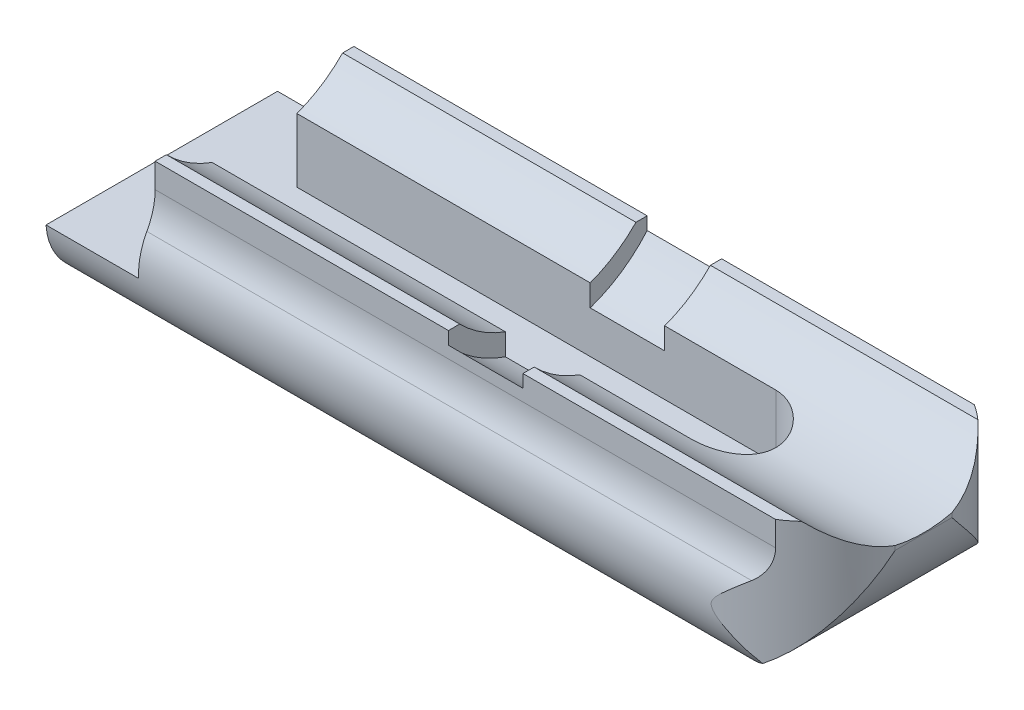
ISO-10303-21;
HEADER;
FILE_DESCRIPTION(('STEP AP214'),'2;1');
FILE_NAME('part.step','',(''),(''),'','','');
FILE_SCHEMA(('AUTOMOTIVE_DESIGN { 1 0 10303 214 1 1 1 1 }'));
ENDSEC;
DATA;
#1=APPLICATION_CONTEXT('core data for automotive mechanical design processes');
#2=APPLICATION_PROTOCOL_DEFINITION('international standard','automotive_design',2000,#1);
#3=PRODUCT_CONTEXT('',#1,'mechanical');
#4=PRODUCT('Part','Part','',(#3));
#5=PRODUCT_RELATED_PRODUCT_CATEGORY('part','',(#4));
#6=PRODUCT_DEFINITION_FORMATION('','',#4);
#7=PRODUCT_DEFINITION_CONTEXT('part definition',#1,'design');
#8=PRODUCT_DEFINITION('design','',#6,#7);
#9=PRODUCT_DEFINITION_SHAPE('','',#8);
#10=(LENGTH_UNIT() NAMED_UNIT(*) SI_UNIT(.MILLI.,.METRE.));
#11=(NAMED_UNIT(*) PLANE_ANGLE_UNIT() SI_UNIT($,.RADIAN.));
#12=(NAMED_UNIT(*) SI_UNIT($,.STERADIAN.) SOLID_ANGLE_UNIT());
#13=UNCERTAINTY_MEASURE_WITH_UNIT(LENGTH_MEASURE(1.E-05),#10,'distance_accuracy_value','');
#14=(GEOMETRIC_REPRESENTATION_CONTEXT(3) GLOBAL_UNCERTAINTY_ASSIGNED_CONTEXT((#13)) GLOBAL_UNIT_ASSIGNED_CONTEXT((#10,
#11,#12)) REPRESENTATION_CONTEXT('',''));
#15=CARTESIAN_POINT('',(0.,0.,0.));
#16=DIRECTION('',(0.,0.,1.));
#17=DIRECTION('',(1.,0.,0.));
#18=AXIS2_PLACEMENT_3D('',#15,#16,#17);
#19=CARTESIAN_POINT('',(146.05,-13.9676907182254,19.05));
#20=DIRECTION('',(0.,-1.,0.));
#21=DIRECTION('',(0.,0.,-1.));
#22=AXIS2_PLACEMENT_3D('',#19,#20,#21);
#23=PLANE('',#22);
#24=DIRECTION('',(0.,0.,1.));
#25=VECTOR('',#24,1.);
#26=CARTESIAN_POINT('',(74.0156,-13.9676907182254,19.05));
#27=LINE('',#26,#25);
#28=CARTESIAN_POINT('',(74.0156,-13.9676907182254,16.896598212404));
#29=VERTEX_POINT('',#28);
#30=CARTESIAN_POINT('',(74.0156,-13.9676907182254,19.05));
#31=VERTEX_POINT('',#30);
#32=EDGE_CURVE('E291',#29,#31,#27,.T.);
#33=ORIENTED_EDGE('',*,*,#32,.F.);
#34=DIRECTION('',(-1.,0.,0.));
#35=VECTOR('',#34,1.);
#36=CARTESIAN_POINT('',(146.05,-13.9676907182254,16.896598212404));
#37=LINE('',#36,#35);
#38=CARTESIAN_POINT('',(17.78,-13.9676907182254,16.896598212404));
#39=VERTEX_POINT('',#38);
#40=EDGE_CURVE('E573',#29,#39,#37,.T.);
#41=ORIENTED_EDGE('',*,*,#40,.T.);
#42=DIRECTION('',(0.,0.,1.));
#43=VECTOR('',#42,1.);
#44=CARTESIAN_POINT('',(17.78,-13.9676907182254,19.0499999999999));
#45=LINE('',#44,#43);
#46=CARTESIAN_POINT('',(17.78,-13.9676907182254,19.05));
#47=VERTEX_POINT('',#46);
#48=EDGE_CURVE('E613',#39,#47,#45,.T.);
#49=ORIENTED_EDGE('',*,*,#48,.T.);
#50=DIRECTION('',(-1.,0.,0.));
#51=VECTOR('',#50,1.);
#52=CARTESIAN_POINT('',(146.05,-13.9676907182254,19.05));
#53=LINE('',#52,#51);
#54=EDGE_CURVE('E595',#31,#47,#53,.T.);
#55=ORIENTED_EDGE('',*,*,#54,.F.);
#56=EDGE_LOOP('',(#33,#41,#49,#55));
#57=FACE_BOUND('',#56,.T.);
#58=ADVANCED_FACE('F35',(#57),#23,.F.);
#59=CARTESIAN_POINT('',(146.05,-13.9676907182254,-16.896598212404));
#60=DIRECTION('',(0.,-1.,0.));
#61=DIRECTION('',(0.,0.,-1.));
#62=AXIS2_PLACEMENT_3D('',#59,#60,#61);
#63=PLANE('',#62);
#64=DIRECTION('',(0.,0.,1.));
#65=VECTOR('',#64,1.);
#66=CARTESIAN_POINT('',(74.0156,-13.9676907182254,-16.896598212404));
#67=LINE('',#66,#65);
#68=CARTESIAN_POINT('',(74.0156,-13.9676907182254,-19.05));
#69=VERTEX_POINT('',#68);
#70=CARTESIAN_POINT('',(74.0156,-13.9676907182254,-16.896598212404));
#71=VERTEX_POINT('',#70);
#72=EDGE_CURVE('E298',#69,#71,#67,.T.);
#73=ORIENTED_EDGE('',*,*,#72,.F.);
#74=DIRECTION('',(-1.,0.,0.));
#75=VECTOR('',#74,1.);
#76=CARTESIAN_POINT('',(146.05,-13.9676907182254,-19.05));
#77=LINE('',#76,#75);
#78=CARTESIAN_POINT('',(17.78,-13.9676907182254,-19.05));
#79=VERTEX_POINT('',#78);
#80=EDGE_CURVE('E556',#69,#79,#77,.T.);
#81=ORIENTED_EDGE('',*,*,#80,.T.);
#82=DIRECTION('',(0.,0.,1.));
#83=VECTOR('',#82,1.);
#84=CARTESIAN_POINT('',(17.78,-13.9676907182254,-16.896598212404));
#85=LINE('',#84,#83);
#86=CARTESIAN_POINT('',(17.78,-13.9676907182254,-16.896598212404));
#87=VERTEX_POINT('',#86);
#88=EDGE_CURVE('E567',#79,#87,#85,.T.);
#89=ORIENTED_EDGE('',*,*,#88,.T.);
#90=DIRECTION('',(-1.,0.,0.));
#91=VECTOR('',#90,1.);
#92=CARTESIAN_POINT('',(146.05,-13.9676907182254,-16.896598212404));
#93=LINE('',#92,#91);
#94=EDGE_CURVE('E566',#71,#87,#93,.T.);
#95=ORIENTED_EDGE('',*,*,#94,.F.);
#96=EDGE_LOOP('',(#73,#81,#89,#95));
#97=FACE_BOUND('',#96,.T.);
#98=ADVANCED_FACE('F563',(#97),#63,.F.);
#99=CARTESIAN_POINT('',(146.05,-13.9676907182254,19.05));
#100=DIRECTION('',(0.,0.,-1.));
#101=DIRECTION('',(0.,1.,0.));
#102=AXIS2_PLACEMENT_3D('',#99,#100,#101);
#103=PLANE('',#102);
#104=DIRECTION('',(0.,-1.,0.));
#105=VECTOR('',#104,1.);
#106=CARTESIAN_POINT('',(74.0156,-13.9676907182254,19.05));
#107=LINE('',#106,#105);
#108=CARTESIAN_POINT('',(74.0156,-16.413982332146,19.05));
#109=VERTEX_POINT('',#108);
#110=EDGE_CURVE('E294',#31,#109,#107,.T.);
#111=ORIENTED_EDGE('',*,*,#110,.F.);
#112=ORIENTED_EDGE('',*,*,#54,.T.);
#113=DIRECTION('',(0.,-1.,0.));
#114=VECTOR('',#113,1.);
#115=CARTESIAN_POINT('',(17.78,-13.9676907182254,19.05));
#116=LINE('',#115,#114);
#117=CARTESIAN_POINT('',(17.78,-18.6889685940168,19.05));
#118=VERTEX_POINT('',#117);
#119=EDGE_CURVE('E631',#47,#118,#116,.T.);
#120=ORIENTED_EDGE('',*,*,#119,.T.);
#121=DIRECTION('',(-1.,0.,0.));
#122=VECTOR('',#121,1.);
#123=CARTESIAN_POINT('',(146.05,-18.6889685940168,19.05));
#124=LINE('',#123,#122);
#125=CARTESIAN_POINT('',(136.736126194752,-18.6889685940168,19.05));
#126=VERTEX_POINT('',#125);
#127=EDGE_CURVE('E592',#126,#118,#124,.T.);
#128=ORIENTED_EDGE('',*,*,#127,.F.);
#129=DIRECTION('',(0.,1.,0.));
#130=VECTOR('',#129,1.);
#131=CARTESIAN_POINT('',(136.736126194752,-42.5426907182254,19.05));
#132=LINE('',#131,#130);
#133=CARTESIAN_POINT('',(136.736126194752,-13.9676907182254,19.05));
#134=VERTEX_POINT('',#133);
#135=EDGE_CURVE('E750',#126,#134,#132,.T.);
#136=ORIENTED_EDGE('',*,*,#135,.T.);
#137=CARTESIAN_POINT('',(88.2904,-13.9676907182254,19.05));
#138=VERTEX_POINT('',#137);
#139=EDGE_CURVE('E273',#134,#138,#53,.T.);
#140=ORIENTED_EDGE('',*,*,#139,.T.);
#141=DIRECTION('',(0.,-1.,0.));
#142=VECTOR('',#141,1.);
#143=CARTESIAN_POINT('',(88.2904,-13.9676907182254,19.05));
#144=LINE('',#143,#142);
#145=CARTESIAN_POINT('',(88.2904,-16.413982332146,19.05));
#146=VERTEX_POINT('',#145);
#147=EDGE_CURVE('E264',#138,#146,#144,.T.);
#148=ORIENTED_EDGE('',*,*,#147,.T.);
#149=DIRECTION('',(1.,0.,0.));
#150=VECTOR('',#149,1.);
#151=CARTESIAN_POINT('',(74.0156,-16.413982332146,19.05));
#152=LINE('',#151,#150);
#153=EDGE_CURVE('E250',#146,#109,#152,.F.);
#154=ORIENTED_EDGE('',*,*,#153,.T.);
#155=EDGE_LOOP('',(#111,#112,#120,#128,#136,#140,#148,#154));
#156=FACE_BOUND('',#155,.T.);
#157=ADVANCED_FACE('F270',(#156),#103,.F.);
#158=CARTESIAN_POINT('',(146.05,-13.9676907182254,-19.05));
#159=DIRECTION('',(0.,0.,1.));
#160=DIRECTION('',(0.,-1.,0.));
#161=AXIS2_PLACEMENT_3D('',#158,#159,#160);
#162=PLANE('',#161);
#163=DIRECTION('',(0.,1.,0.));
#164=VECTOR('',#163,1.);
#165=CARTESIAN_POINT('',(74.0156,-13.9676907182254,-19.05));
#166=LINE('',#165,#164);
#167=CARTESIAN_POINT('',(74.0156,-16.413982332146,-19.05));
#168=VERTEX_POINT('',#167);
#169=EDGE_CURVE('E300',#168,#69,#166,.T.);
#170=ORIENTED_EDGE('',*,*,#169,.F.);
#171=DIRECTION('',(1.,0.,0.));
#172=VECTOR('',#171,1.);
#173=CARTESIAN_POINT('',(74.0156,-16.413982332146,-19.05));
#174=LINE('',#173,#172);
#175=CARTESIAN_POINT('',(88.2904,-16.413982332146,-19.05));
#176=VERTEX_POINT('',#175);
#177=EDGE_CURVE('E261',#168,#176,#174,.T.);
#178=ORIENTED_EDGE('',*,*,#177,.T.);
#179=DIRECTION('',(0.,1.,0.));
#180=VECTOR('',#179,1.);
#181=CARTESIAN_POINT('',(88.2904,-13.9676907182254,-19.05));
#182=LINE('',#181,#180);
#183=CARTESIAN_POINT('',(88.2904,-13.9676907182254,-19.05));
#184=VERTEX_POINT('',#183);
#185=EDGE_CURVE('E286',#176,#184,#182,.T.);
#186=ORIENTED_EDGE('',*,*,#185,.T.);
#187=CARTESIAN_POINT('',(136.736126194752,-13.9676907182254,-19.05));
#188=VERTEX_POINT('',#187);
#189=EDGE_CURVE('E577',#188,#184,#77,.T.);
#190=ORIENTED_EDGE('',*,*,#189,.F.);
#191=DIRECTION('',(0.,1.,0.));
#192=VECTOR('',#191,1.);
#193=CARTESIAN_POINT('',(136.736126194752,-42.5426907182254,-19.05));
#194=LINE('',#193,#192);
#195=CARTESIAN_POINT('',(136.736126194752,-18.6889685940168,-19.05));
#196=VERTEX_POINT('',#195);
#197=EDGE_CURVE('E722',#188,#196,#194,.F.);
#198=ORIENTED_EDGE('',*,*,#197,.T.);
#199=DIRECTION('',(-1.,0.,0.));
#200=VECTOR('',#199,1.);
#201=CARTESIAN_POINT('',(146.05,-18.6889685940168,-19.05));
#202=LINE('',#201,#200);
#203=CARTESIAN_POINT('',(17.78,-18.6889685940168,-19.05));
#204=VERTEX_POINT('',#203);
#205=EDGE_CURVE('E579',#196,#204,#202,.T.);
#206=ORIENTED_EDGE('',*,*,#205,.T.);
#207=DIRECTION('',(0.,1.,0.));
#208=VECTOR('',#207,1.);
#209=CARTESIAN_POINT('',(17.78,-13.9676907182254,-19.05));
#210=LINE('',#209,#208);
#211=EDGE_CURVE('E641',#204,#79,#210,.T.);
#212=ORIENTED_EDGE('',*,*,#211,.T.);
#213=ORIENTED_EDGE('',*,*,#80,.F.);
#214=EDGE_LOOP('',(#170,#178,#186,#190,#198,#206,#212,#213));
#215=FACE_BOUND('',#214,.T.);
#216=ADVANCED_FACE('F551',(#215),#162,.F.);
#217=CARTESIAN_POINT('',(146.05,2.54,0.));
#218=DIRECTION('',(-1.,0.,0.));
#219=DIRECTION('',(0.,0.,1.));
#220=AXIS2_PLACEMENT_3D('',#217,#218,#219);
#221=CYLINDRICAL_SURFACE('',#220,23.622);
#222=CARTESIAN_POINT('',(74.0156,2.54,0.));
#223=DIRECTION('',(1.,0.,0.));
#224=DIRECTION('',(0.,0.,-1.));
#225=AXIS2_PLACEMENT_3D('',#222,#223,#224);
#226=CIRCLE('',#225,23.622);
#227=CARTESIAN_POINT('',(74.0156,-19.6395964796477,-8.128));
#228=VERTEX_POINT('',#227);
#229=EDGE_CURVE('E292',#71,#228,#226,.F.);
#230=ORIENTED_EDGE('',*,*,#229,.F.);
#231=ORIENTED_EDGE('',*,*,#94,.T.);
#232=CARTESIAN_POINT('',(17.78,2.54,0.));
#233=DIRECTION('',(1.,0.,0.));
#234=DIRECTION('',(0.,0.,-1.));
#235=AXIS2_PLACEMENT_3D('',#232,#233,#234);
#236=CIRCLE('',#235,23.622);
#237=CARTESIAN_POINT('',(17.78,-19.6395964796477,-8.12800000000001));
#238=VERTEX_POINT('',#237);
#239=EDGE_CURVE('E520',#87,#238,#236,.F.);
#240=ORIENTED_EDGE('',*,*,#239,.T.);
#241=DIRECTION('',(-1.,0.,0.));
#242=VECTOR('',#241,1.);
#243=CARTESIAN_POINT('',(146.05,-19.6395964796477,-8.128));
#244=LINE('',#243,#242);
#245=EDGE_CURVE('E518',#238,#228,#244,.F.);
#246=ORIENTED_EDGE('',*,*,#245,.T.);
#247=EDGE_LOOP('',(#230,#231,#240,#246));
#248=FACE_BOUND('',#247,.T.);
#249=ADVANCED_FACE('F499',(#248),#221,.F.);
#250=CARTESIAN_POINT('',(74.0156,-19.6395964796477,8.128));
#251=VERTEX_POINT('',#250);
#252=EDGE_CURVE('E289',#251,#29,#226,.F.);
#253=ORIENTED_EDGE('',*,*,#252,.F.);
#254=DIRECTION('',(-1.,0.,0.));
#255=VECTOR('',#254,1.);
#256=CARTESIAN_POINT('',(146.05,-19.6395964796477,8.128));
#257=LINE('',#256,#255);
#258=CARTESIAN_POINT('',(17.78,-19.6395964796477,8.12800000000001));
#259=VERTEX_POINT('',#258);
#260=EDGE_CURVE('E598',#251,#259,#257,.T.);
#261=ORIENTED_EDGE('',*,*,#260,.T.);
#262=CARTESIAN_POINT('',(17.78,2.54,0.));
#263=DIRECTION('',(1.,0.,0.));
#264=DIRECTION('',(0.,0.,-1.));
#265=AXIS2_PLACEMENT_3D('',#262,#263,#264);
#266=CIRCLE('',#265,23.622);
#267=EDGE_CURVE('E516',#259,#39,#266,.F.);
#268=ORIENTED_EDGE('',*,*,#267,.T.);
#269=ORIENTED_EDGE('',*,*,#40,.F.);
#270=EDGE_LOOP('',(#253,#261,#268,#269));
#271=FACE_BOUND('',#270,.T.);
#272=ADVANCED_FACE('F500',(#271),#221,.F.);
#273=CARTESIAN_POINT('',(109.601,-12.64139468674,-8.128));
#274=DIRECTION('',(0.,0.,-1.));
#275=DIRECTION('',(-1.,0.,0.));
#276=AXIS2_PLACEMENT_3D('',#273,#274,#275);
#277=PLANE('',#276);
#278=DIRECTION('',(0.,-1.,0.));
#279=VECTOR('',#278,1.);
#280=CARTESIAN_POINT('',(74.0156,-12.64139468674,-8.128));
#281=LINE('',#280,#279);
#282=CARTESIAN_POINT('',(74.0156,-23.7961537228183,-8.128));
#283=VERTEX_POINT('',#282);
#284=EDGE_CURVE('E296',#228,#283,#281,.T.);
#285=ORIENTED_EDGE('',*,*,#284,.F.);
#286=ORIENTED_EDGE('',*,*,#245,.F.);
#287=DIRECTION('',(0.,-1.,0.));
#288=VECTOR('',#287,1.);
#289=CARTESIAN_POINT('',(17.78,-12.64139468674,-8.12800000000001));
#290=LINE('',#289,#288);
#291=CARTESIAN_POINT('',(17.78,-31.8746907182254,-8.12800000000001));
#292=VERTEX_POINT('',#291);
#293=EDGE_CURVE('E617',#238,#292,#290,.T.);
#294=ORIENTED_EDGE('',*,*,#293,.T.);
#295=DIRECTION('',(1.,0.,0.));
#296=VECTOR('',#295,1.);
#297=CARTESIAN_POINT('',(109.601,-31.8746907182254,-8.128));
#298=LINE('',#297,#296);
#299=CARTESIAN_POINT('',(109.601,-31.8746907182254,-8.128));
#300=VERTEX_POINT('',#299);
#301=EDGE_CURVE('E622',#292,#300,#298,.T.);
#302=ORIENTED_EDGE('',*,*,#301,.T.);
#303=DIRECTION('',(0.,-1.,0.));
#304=VECTOR('',#303,1.);
#305=CARTESIAN_POINT('',(109.601,-12.64139468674,-8.128));
#306=LINE('',#305,#304);
#307=CARTESIAN_POINT('',(109.601,-19.6395964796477,-8.128));
#308=VERTEX_POINT('',#307);
#309=EDGE_CURVE('E620',#308,#300,#306,.T.);
#310=ORIENTED_EDGE('',*,*,#309,.F.);
#311=CARTESIAN_POINT('',(88.2904,-19.6395964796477,-8.128));
#312=VERTEX_POINT('',#311);
#313=EDGE_CURVE('E515',#312,#308,#244,.F.);
#314=ORIENTED_EDGE('',*,*,#313,.F.);
#315=DIRECTION('',(0.,-1.,0.));
#316=VECTOR('',#315,1.);
#317=CARTESIAN_POINT('',(88.2904,-12.64139468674,-8.128));
#318=LINE('',#317,#316);
#319=CARTESIAN_POINT('',(88.2904,-23.7961537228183,-8.128));
#320=VERTEX_POINT('',#319);
#321=EDGE_CURVE('E274',#312,#320,#318,.T.);
#322=ORIENTED_EDGE('',*,*,#321,.T.);
#323=DIRECTION('',(1.,0.,0.));
#324=VECTOR('',#323,1.);
#325=CARTESIAN_POINT('',(74.0156,-23.7961537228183,-8.128));
#326=LINE('',#325,#324);
#327=EDGE_CURVE('E302',#320,#283,#326,.F.);
#328=ORIENTED_EDGE('',*,*,#327,.T.);
#329=EDGE_LOOP('',(#285,#286,#294,#302,#310,#314,#322,#328));
#330=FACE_BOUND('',#329,.T.);
#331=ADVANCED_FACE('F713',(#330),#277,.F.);
#332=CARTESIAN_POINT('',(109.601,-12.64139468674,8.128));
#333=DIRECTION('',(0.,0.,1.));
#334=DIRECTION('',(1.,0.,0.));
#335=AXIS2_PLACEMENT_3D('',#332,#333,#334);
#336=PLANE('',#335);
#337=DIRECTION('',(0.,1.,0.));
#338=VECTOR('',#337,1.);
#339=CARTESIAN_POINT('',(74.0156,-12.64139468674,8.128));
#340=LINE('',#339,#338);
#341=CARTESIAN_POINT('',(74.0156,-23.7961537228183,8.128));
#342=VERTEX_POINT('',#341);
#343=EDGE_CURVE('E11',#342,#251,#340,.T.);
#344=ORIENTED_EDGE('',*,*,#343,.F.);
#345=DIRECTION('',(1.,0.,0.));
#346=VECTOR('',#345,1.);
#347=CARTESIAN_POINT('',(74.0156,-23.7961537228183,8.128));
#348=LINE('',#347,#346);
#349=CARTESIAN_POINT('',(88.2904,-23.7961537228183,8.128));
#350=VERTEX_POINT('',#349);
#351=EDGE_CURVE('E43',#342,#350,#348,.T.);
#352=ORIENTED_EDGE('',*,*,#351,.T.);
#353=DIRECTION('',(0.,1.,0.));
#354=VECTOR('',#353,1.);
#355=CARTESIAN_POINT('',(88.2904,-12.64139468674,8.128));
#356=LINE('',#355,#354);
#357=CARTESIAN_POINT('',(88.2904,-19.6395964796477,8.128));
#358=VERTEX_POINT('',#357);
#359=EDGE_CURVE('E266',#350,#358,#356,.T.);
#360=ORIENTED_EDGE('',*,*,#359,.T.);
#361=CARTESIAN_POINT('',(109.601,-19.6395964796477,8.128));
#362=VERTEX_POINT('',#361);
#363=EDGE_CURVE('E599',#362,#358,#257,.T.);
#364=ORIENTED_EDGE('',*,*,#363,.F.);
#365=DIRECTION('',(0.,-1.,0.));
#366=VECTOR('',#365,1.);
#367=CARTESIAN_POINT('',(109.601,-12.64139468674,8.128));
#368=LINE('',#367,#366);
#369=CARTESIAN_POINT('',(109.601,-31.8746907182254,8.128));
#370=VERTEX_POINT('',#369);
#371=EDGE_CURVE('E618',#362,#370,#368,.T.);
#372=ORIENTED_EDGE('',*,*,#371,.T.);
#373=DIRECTION('',(-1.,0.,0.));
#374=VECTOR('',#373,1.);
#375=CARTESIAN_POINT('',(109.601,-31.8746907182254,8.128));
#376=LINE('',#375,#374);
#377=CARTESIAN_POINT('',(17.78,-31.8746907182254,8.12800000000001));
#378=VERTEX_POINT('',#377);
#379=EDGE_CURVE('E616',#370,#378,#376,.T.);
#380=ORIENTED_EDGE('',*,*,#379,.T.);
#381=DIRECTION('',(0.,-1.,0.));
#382=VECTOR('',#381,1.);
#383=CARTESIAN_POINT('',(17.78,-12.64139468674,8.12800000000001));
#384=LINE('',#383,#382);
#385=EDGE_CURVE('E609',#259,#378,#384,.T.);
#386=ORIENTED_EDGE('',*,*,#385,.F.);
#387=ORIENTED_EDGE('',*,*,#260,.F.);
#388=EDGE_LOOP('',(#344,#352,#360,#364,#372,#380,#386,#387));
#389=FACE_BOUND('',#388,.T.);
#390=ADVANCED_FACE('F538',(#389),#336,.F.);
#391=CARTESIAN_POINT('',(146.05,-42.5426907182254,14.7905247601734));
#392=DIRECTION('',(0.,1.,0.));
#393=DIRECTION('',(0.,0.,1.));
#394=AXIS2_PLACEMENT_3D('',#391,#392,#393);
#395=PLANE('',#394);
#396=DIRECTION('',(-1.,0.,0.));
#397=VECTOR('',#396,1.);
#398=CARTESIAN_POINT('',(146.05,-42.5426907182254,-14.7905247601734));
#399=LINE('',#398,#397);
#400=CARTESIAN_POINT('',(122.098326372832,-42.5426907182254,-14.7905247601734));
#401=VERTEX_POINT('',#400);
#402=CARTESIAN_POINT('',(0.,-42.5426907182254,-14.7905247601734));
#403=VERTEX_POINT('',#402);
#404=EDGE_CURVE('E585',#401,#403,#399,.T.);
#405=ORIENTED_EDGE('',*,*,#404,.F.);
#406=DIRECTION('',(0.,0.,1.));
#407=VECTOR('',#406,1.);
#408=CARTESIAN_POINT('',(122.098326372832,-42.5426907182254,-22.225));
#409=LINE('',#408,#407);
#410=CARTESIAN_POINT('',(122.098326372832,-42.5426907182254,14.7905247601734));
#411=VERTEX_POINT('',#410);
#412=EDGE_CURVE('E373',#401,#411,#409,.T.);
#413=ORIENTED_EDGE('',*,*,#412,.T.);
#414=DIRECTION('',(-1.,0.,0.));
#415=VECTOR('',#414,1.);
#416=CARTESIAN_POINT('',(146.05,-42.5426907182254,14.7905247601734));
#417=LINE('',#416,#415);
#418=CARTESIAN_POINT('',(0.,-42.5426907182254,14.7905247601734));
#419=VERTEX_POINT('',#418);
#420=EDGE_CURVE('E587',#411,#419,#417,.T.);
#421=ORIENTED_EDGE('',*,*,#420,.T.);
#422=DIRECTION('',(0.,0.,-1.));
#423=VECTOR('',#422,1.);
#424=CARTESIAN_POINT('',(0.,-42.5426907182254,14.7905247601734));
#425=LINE('',#424,#423);
#426=EDGE_CURVE('E664',#419,#403,#425,.T.);
#427=ORIENTED_EDGE('',*,*,#426,.T.);
#428=EDGE_LOOP('',(#405,#413,#421,#427));
#429=FACE_BOUND('',#428,.T.);
#430=DIRECTION('',(1.,0.,0.));
#431=VECTOR('',#430,1.);
#432=CARTESIAN_POINT('',(146.05,-42.5426907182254,-7.02310000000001));
#433=LINE('',#432,#431);
#434=CARTESIAN_POINT('',(80.5306999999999,-42.5426907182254,-7.02310000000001));
#435=VERTEX_POINT('',#434);
#436=CARTESIAN_POINT('',(109.4613,-42.5426907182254,-7.02310000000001));
#437=VERTEX_POINT('',#436);
#438=EDGE_CURVE('E529',#435,#437,#433,.T.);
#439=ORIENTED_EDGE('',*,*,#438,.F.);
#440=CARTESIAN_POINT('',(80.5306999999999,-42.5426907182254,0.));
#441=DIRECTION('',(0.,1.,0.));
#442=DIRECTION('',(1.,0.,0.));
#443=AXIS2_PLACEMENT_3D('',#440,#441,#442);
#444=CIRCLE('',#443,7.0231);
#445=CARTESIAN_POINT('',(80.5306999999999,-42.5426907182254,7.02309999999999));
#446=VERTEX_POINT('',#445);
#447=EDGE_CURVE('E354',#446,#435,#444,.F.);
#448=ORIENTED_EDGE('',*,*,#447,.F.);
#449=DIRECTION('',(1.,0.,0.));
#450=VECTOR('',#449,1.);
#451=CARTESIAN_POINT('',(146.05,-42.5426907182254,7.02309999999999));
#452=LINE('',#451,#450);
#453=CARTESIAN_POINT('',(109.4613,-42.5426907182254,7.02309999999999));
#454=VERTEX_POINT('',#453);
#455=EDGE_CURVE('E525',#446,#454,#452,.T.);
#456=ORIENTED_EDGE('',*,*,#455,.T.);
#457=CARTESIAN_POINT('',(109.4613,-42.5426907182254,0.));
#458=DIRECTION('',(0.,1.,0.));
#459=DIRECTION('',(1.,0.,0.));
#460=AXIS2_PLACEMENT_3D('',#457,#458,#459);
#461=CIRCLE('',#460,7.0231);
#462=EDGE_CURVE('E343',#437,#454,#461,.F.);
#463=ORIENTED_EDGE('',*,*,#462,.F.);
#464=EDGE_LOOP('',(#439,#448,#456,#463));
#465=FACE_BOUND('',#464,.T.);
#466=ADVANCED_FACE('F440',(#429,#465),#395,.F.);
#467=CARTESIAN_POINT('',(109.093,-42.5426907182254,0.));
#468=DIRECTION('',(0.,1.,0.));
#469=DIRECTION('',(0.,0.,1.));
#470=AXIS2_PLACEMENT_3D('',#467,#468,#469);
#471=CYLINDRICAL_SURFACE('',#470,2.0955);
#472=CARTESIAN_POINT('',(109.093,-31.8746907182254,0.));
#473=DIRECTION('',(0.,1.,0.));
#474=DIRECTION('',(0.,0.,1.));
#475=AXIS2_PLACEMENT_3D('',#472,#473,#474);
#476=CIRCLE('',#475,2.0955);
#477=CARTESIAN_POINT('',(109.093,-31.8746907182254,2.0955));
#478=VERTEX_POINT('',#477);
#479=EDGE_CURVE('E369',#478,#478,#476,.T.);
#480=ORIENTED_EDGE('',*,*,#479,.T.);
#481=EDGE_LOOP('',(#480));
#482=FACE_BOUND('',#481,.T.);
#483=CARTESIAN_POINT('',(109.093,-40.9424907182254,0.));
#484=DIRECTION('',(0.,-1.,0.));
#485=DIRECTION('',(1.,0.,0.));
#486=AXIS2_PLACEMENT_3D('',#483,#484,#485);
#487=CIRCLE('',#486,2.0955);
#488=CARTESIAN_POINT('',(111.1885,-40.9424907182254,0.));
#489=VERTEX_POINT('',#488);
#490=EDGE_CURVE('E315',#489,#489,#487,.F.);
#491=ORIENTED_EDGE('',*,*,#490,.F.);
#492=EDGE_LOOP('',(#491));
#493=FACE_BOUND('',#492,.T.);
#494=ADVANCED_FACE('F408',(#482,#493),#471,.F.);
#495=CARTESIAN_POINT('',(81.153,-42.5426907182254,0.));
#496=DIRECTION('',(0.,1.,0.));
#497=DIRECTION('',(0.,0.,1.));
#498=AXIS2_PLACEMENT_3D('',#495,#496,#497);
#499=CYLINDRICAL_SURFACE('',#498,1.5875);
#500=CARTESIAN_POINT('',(81.153,-31.8746907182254,0.));
#501=DIRECTION('',(0.,1.,0.));
#502=DIRECTION('',(0.,0.,1.));
#503=AXIS2_PLACEMENT_3D('',#500,#501,#502);
#504=CIRCLE('',#503,1.5875);
#505=CARTESIAN_POINT('',(81.153,-31.8746907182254,1.5875));
#506=VERTEX_POINT('',#505);
#507=EDGE_CURVE('E370',#506,#506,#504,.T.);
#508=ORIENTED_EDGE('',*,*,#507,.T.);
#509=EDGE_LOOP('',(#508));
#510=FACE_BOUND('',#509,.T.);
#511=CARTESIAN_POINT('',(81.153,-40.9424907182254,0.));
#512=DIRECTION('',(0.,-1.,0.));
#513=DIRECTION('',(1.,0.,0.));
#514=AXIS2_PLACEMENT_3D('',#511,#512,#513);
#515=CIRCLE('',#514,1.5875);
#516=CARTESIAN_POINT('',(82.7405,-40.9424907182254,0.));
#517=VERTEX_POINT('',#516);
#518=EDGE_CURVE('E312',#517,#517,#515,.F.);
#519=ORIENTED_EDGE('',*,*,#518,.F.);
#520=EDGE_LOOP('',(#519));
#521=FACE_BOUND('',#520,.T.);
#522=ADVANCED_FACE('F748',(#510,#521),#499,.F.);
#523=CARTESIAN_POINT('',(0.,2.54,0.));
#524=DIRECTION('',(1.,0.,0.));
#525=DIRECTION('',(0.,0.,-1.));
#526=AXIS2_PLACEMENT_3D('',#523,#524,#525);
#527=PLANE('',#526);
#528=DIRECTION('',(0.,0.,1.));
#529=VECTOR('',#528,1.);
#530=CARTESIAN_POINT('',(0.,-31.8746907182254,0.));
#531=LINE('',#530,#529);
#532=CARTESIAN_POINT('',(0.,-31.8746907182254,-22.1938467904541));
#533=VERTEX_POINT('',#532);
#534=CARTESIAN_POINT('',(0.,-31.8746907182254,22.1938467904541));
#535=VERTEX_POINT('',#534);
#536=EDGE_CURVE('E597',#533,#535,#531,.T.);
#537=ORIENTED_EDGE('',*,*,#536,.F.);
#538=CARTESIAN_POINT('',(0.,-30.9856907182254,-9.525));
#539=DIRECTION('',(1.,0.,0.));
#540=DIRECTION('',(0.,0.,1.));
#541=AXIS2_PLACEMENT_3D('',#538,#539,#540);
#542=CIRCLE('',#541,12.7);
#543=EDGE_CURVE('E661',#403,#533,#542,.T.);
#544=ORIENTED_EDGE('',*,*,#543,.F.);
#545=ORIENTED_EDGE('',*,*,#426,.F.);
#546=CARTESIAN_POINT('',(0.,-30.9856907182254,9.525));
#547=DIRECTION('',(1.,0.,0.));
#548=DIRECTION('',(0.,0.,-1.));
#549=AXIS2_PLACEMENT_3D('',#546,#547,#548);
#550=CIRCLE('',#549,12.7);
#551=EDGE_CURVE('E673',#535,#419,#550,.T.);
#552=ORIENTED_EDGE('',*,*,#551,.F.);
#553=EDGE_LOOP('',(#537,#544,#545,#552));
#554=FACE_BOUND('',#553,.T.);
#555=ADVANCED_FACE('F501',(#554),#527,.F.);
#556=CARTESIAN_POINT('',(139.560846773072,-13.9676907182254,16.896598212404));
#557=VERTEX_POINT('',#556);
#558=CARTESIAN_POINT('',(88.2904,-13.9676907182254,16.896598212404));
#559=VERTEX_POINT('',#558);
#560=EDGE_CURVE('E569',#557,#559,#37,.T.);
#561=ORIENTED_EDGE('',*,*,#560,.T.);
#562=DIRECTION('',(0.,0.,1.));
#563=VECTOR('',#562,1.);
#564=CARTESIAN_POINT('',(88.2904,-13.9676907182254,19.05));
#565=LINE('',#564,#563);
#566=EDGE_CURVE('E275',#559,#138,#565,.T.);
#567=ORIENTED_EDGE('',*,*,#566,.T.);
#568=ORIENTED_EDGE('',*,*,#139,.F.);
#569=CARTESIAN_POINT('',(125.476,-13.9676907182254,1.35018977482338));
#570=DIRECTION('',(0.,-1.,0.));
#571=DIRECTION('',(0.,0.,-1.));
#572=AXIS2_PLACEMENT_3D('',#569,#570,#571);
#573=CIRCLE('',#572,20.9779342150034);
#574=EDGE_CURVE('E488',#134,#557,#573,.F.);
#575=ORIENTED_EDGE('',*,*,#574,.T.);
#576=EDGE_LOOP('',(#561,#567,#568,#575));
#577=FACE_BOUND('',#576,.T.);
#578=ADVANCED_FACE('F37',(#577),#23,.F.);
#579=ORIENTED_EDGE('',*,*,#189,.T.);
#580=DIRECTION('',(0.,0.,1.));
#581=VECTOR('',#580,1.);
#582=CARTESIAN_POINT('',(88.2904,-13.9676907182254,-16.896598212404));
#583=LINE('',#582,#581);
#584=CARTESIAN_POINT('',(88.2904,-13.9676907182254,-16.896598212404));
#585=VERTEX_POINT('',#584);
#586=EDGE_CURVE('E283',#184,#585,#583,.T.);
#587=ORIENTED_EDGE('',*,*,#586,.T.);
#588=CARTESIAN_POINT('',(139.560846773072,-13.9676907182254,-16.896598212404));
#589=VERTEX_POINT('',#588);
#590=EDGE_CURVE('E568',#589,#585,#93,.T.);
#591=ORIENTED_EDGE('',*,*,#590,.F.);
#592=CARTESIAN_POINT('',(125.476,-13.9676907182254,-1.35018977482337));
#593=DIRECTION('',(0.,-1.,0.));
#594=DIRECTION('',(0.,0.,-1.));
#595=AXIS2_PLACEMENT_3D('',#592,#593,#594);
#596=CIRCLE('',#595,20.9779342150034);
#597=EDGE_CURVE('E658',#589,#188,#596,.F.);
#598=ORIENTED_EDGE('',*,*,#597,.T.);
#599=EDGE_LOOP('',(#579,#587,#591,#598));
#600=FACE_BOUND('',#599,.T.);
#601=ADVANCED_FACE('F502',(#600),#63,.F.);
#602=CARTESIAN_POINT('',(146.05,-18.6889685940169,31.75));
#603=DIRECTION('',(-1.,0.,0.));
#604=DIRECTION('',(0.,0.,1.));
#605=AXIS2_PLACEMENT_3D('',#602,#603,#604);
#606=CYLINDRICAL_SURFACE('',#605,12.7);
#607=ORIENTED_EDGE('',*,*,#127,.T.);
#608=CARTESIAN_POINT('',(17.78,-18.6889685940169,31.75));
#609=DIRECTION('',(1.,0.,0.));
#610=DIRECTION('',(0.,0.,-1.));
#611=AXIS2_PLACEMENT_3D('',#608,#609,#610);
#612=CIRCLE('',#611,12.7);
#613=CARTESIAN_POINT('',(17.78,-24.8373296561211,20.6375));
#614=VERTEX_POINT('',#613);
#615=EDGE_CURVE('E634',#118,#614,#612,.F.);
#616=ORIENTED_EDGE('',*,*,#615,.T.);
#617=DIRECTION('',(-1.,0.,0.));
#618=VECTOR('',#617,1.);
#619=CARTESIAN_POINT('',(146.05,-24.8373296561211,20.6375));
#620=LINE('',#619,#618);
#621=CARTESIAN_POINT('',(133.726659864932,-24.8373296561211,20.6375));
#622=VERTEX_POINT('',#621);
#623=EDGE_CURVE('E589',#622,#614,#620,.T.);
#624=ORIENTED_EDGE('',*,*,#623,.F.);
#625=CARTESIAN_POINT('',(133.726659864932,-24.8373296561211,20.6375));
#626=CARTESIAN_POINT('',(133.888639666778,-24.7121228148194,20.5682277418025));
#627=CARTESIAN_POINT('',(134.045983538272,-24.5810831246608,20.4984872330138));
#628=CARTESIAN_POINT('',(134.350445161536,-24.3072681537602,20.35928744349));
#629=CARTESIAN_POINT('',(134.497555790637,-24.1644848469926,20.2898283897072));
#630=CARTESIAN_POINT('',(134.781059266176,-23.8665615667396,20.1521737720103));
#631=CARTESIAN_POINT('',(134.917396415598,-23.7113647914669,20.0839860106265));
#632=CARTESIAN_POINT('',(135.177450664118,-23.3895574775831,19.9506445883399));
#633=CARTESIAN_POINT('',(135.301170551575,-23.2229494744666,19.8854902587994));
#634=CARTESIAN_POINT('',(135.535596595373,-22.8779404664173,19.7593196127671));
#635=CARTESIAN_POINT('',(135.646232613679,-22.6994832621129,19.6983262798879));
#636=CARTESIAN_POINT('',(135.852766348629,-22.3323929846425,19.5823174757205));
#637=CARTESIAN_POINT('',(135.948665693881,-22.1437610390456,19.5273013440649));
#638=CARTESIAN_POINT('',(136.124575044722,-21.7580692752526,19.4248103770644));
#639=CARTESIAN_POINT('',(136.2046377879,-21.5610401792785,19.3773106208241));
#640=CARTESIAN_POINT('',(136.34853799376,-21.1593406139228,19.2908892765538));
#641=CARTESIAN_POINT('',(136.412378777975,-20.9546717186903,19.2519659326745));
#642=CARTESIAN_POINT('',(136.51207961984,-20.5811940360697,19.1906315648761));
#643=CARTESIAN_POINT('',(136.550986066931,-20.4134767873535,19.1664735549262));
#644=CARTESIAN_POINT('',(136.61787521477,-20.0750917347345,19.1247190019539));
#645=CARTESIAN_POINT('',(136.645859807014,-19.9044244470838,19.1071213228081));
#646=CARTESIAN_POINT('',(136.690862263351,-19.5601769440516,19.0787357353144));
#647=CARTESIAN_POINT('',(136.707822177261,-19.3865861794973,19.0679838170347));
#648=CARTESIAN_POINT('',(136.730461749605,-19.0383224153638,19.0536030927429));
#649=CARTESIAN_POINT('',(136.736137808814,-18.8636490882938,19.0499765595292));
#650=CARTESIAN_POINT('',(136.736126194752,-18.6889685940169,19.05));
#651=B_SPLINE_CURVE_WITH_KNOTS('',3,(#625,#626,#627,#628,#629,#630,#631,#632,#633,#634,#635,
#636,#637,#638,#639,#640,#641,#642,#643,#644,#645,#646,#647,#648,#649,#650),.UNSPECIFIED.,.F.,
.F.,(4,2,2,2,2,2,2,2,2,2,2,2,4),(0.,0.648348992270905,1.29714483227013,1.9491009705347,
2.600912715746,3.25607380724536,3.91116244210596,4.56403140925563,5.21676659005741,
5.73787303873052,6.25888919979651,6.78262235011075,7.30652252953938),.UNSPECIFIED.);
#652=EDGE_CURVE('E452',#622,#126,#651,.T.);
#653=ORIENTED_EDGE('',*,*,#652,.T.);
#654=EDGE_LOOP('',(#607,#616,#624,#653));
#655=FACE_BOUND('',#654,.T.);
#656=ADVANCED_FACE('F438',(#655),#606,.F.);
#657=CARTESIAN_POINT('',(146.05,-30.9856907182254,9.525));
#658=DIRECTION('',(-1.,0.,0.));
#659=DIRECTION('',(0.,0.,1.));
#660=AXIS2_PLACEMENT_3D('',#657,#658,#659);
#661=CYLINDRICAL_SURFACE('',#660,12.7);
#662=ORIENTED_EDGE('',*,*,#420,.F.);
#663=CARTESIAN_POINT('',(122.098326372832,-42.5426907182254,14.7905247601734));
#664=CARTESIAN_POINT('',(122.372163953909,-42.5306538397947,14.816873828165));
#665=CARTESIAN_POINT('',(122.644689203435,-42.5142086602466,14.8528019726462));
#666=CARTESIAN_POINT('',(123.18600501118,-42.472869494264,14.9413920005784));
#667=CARTESIAN_POINT('',(123.454800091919,-42.4479868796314,14.9940313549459));
#668=CARTESIAN_POINT('',(124.25175411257,-42.3615213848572,15.172804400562));
#669=CARTESIAN_POINT('',(124.773855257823,-42.2879642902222,15.3201751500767));
#670=CARTESIAN_POINT('',(125.798128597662,-42.1118197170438,15.65151766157));
#671=CARTESIAN_POINT('',(126.300374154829,-42.0093533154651,15.8353358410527));
#672=CARTESIAN_POINT('',(127.290402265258,-41.7765872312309,16.2256215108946));
#673=CARTESIAN_POINT('',(127.778154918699,-41.6462340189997,16.4321321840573));
#674=CARTESIAN_POINT('',(128.631074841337,-41.3911644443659,16.8089293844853));
#675=CARTESIAN_POINT('',(128.998960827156,-41.2718718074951,16.9768121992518));
#676=CARTESIAN_POINT('',(129.727458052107,-41.0172199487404,17.316240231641));
#677=CARTESIAN_POINT('',(130.088068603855,-40.8818592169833,17.4877857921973));
#678=CARTESIAN_POINT('',(130.802382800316,-40.5950712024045,17.8316198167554));
#679=CARTESIAN_POINT('',(131.156087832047,-40.4436471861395,18.0039081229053));
#680=CARTESIAN_POINT('',(131.856903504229,-40.1245750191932,18.3468870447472));
#681=CARTESIAN_POINT('',(132.20401359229,-39.9569255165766,18.5175775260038));
#682=CARTESIAN_POINT('',(133.237129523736,-39.4285368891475,19.0248428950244));
#683=CARTESIAN_POINT('',(133.913401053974,-39.0429664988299,19.3558609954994));
#684=CARTESIAN_POINT('',(135.237364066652,-38.2041254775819,19.9873070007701));
#685=CARTESIAN_POINT('',(135.885073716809,-37.7508987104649,20.2877545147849));
#686=CARTESIAN_POINT('',(136.905299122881,-36.9622490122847,20.7361772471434));
#687=CARTESIAN_POINT('',(137.288157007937,-36.6482375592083,20.8984610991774));
#688=CARTESIAN_POINT('',(138.039644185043,-35.9937178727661,21.2014597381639));
#689=CARTESIAN_POINT('',(138.408273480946,-35.6532096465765,21.3421745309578));
#690=CARTESIAN_POINT('',(139.127674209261,-34.9475093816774,21.59703925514));
#691=CARTESIAN_POINT('',(139.478514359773,-34.5824274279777,21.7112986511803));
#692=CARTESIAN_POINT('',(140.161356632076,-33.8274109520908,21.9091362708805));
#693=CARTESIAN_POINT('',(140.493368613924,-33.437489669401,21.9927306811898));
#694=CARTESIAN_POINT('',(141.102750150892,-32.6758703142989,22.1173131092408));
#695=CARTESIAN_POINT('',(141.382222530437,-32.3064455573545,22.1618082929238));
#696=CARTESIAN_POINT('',(141.787044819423,-31.7395955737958,22.2040247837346));
#697=CARTESIAN_POINT('',(141.919754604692,-31.5482640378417,22.2140061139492));
#698=CARTESIAN_POINT('',(142.180007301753,-31.1618055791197,22.2252502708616));
#699=CARTESIAN_POINT('',(142.30754899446,-30.966677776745,22.2265110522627));
#700=CARTESIAN_POINT('',(142.432362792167,-30.7698448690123,22.2231656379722));
#701=B_SPLINE_CURVE_WITH_KNOTS('',3,(#663,#664,#665,#666,#667,#668,#669,#670,#671,#672,#673,
#674,#675,#676,#677,#678,#679,#680,#681,#682,#683,#684,#685,#686,#687,#688,#689,#690,#691,#692,
#693,#694,#695,#696,#697,#698,#699,#700),.UNSPECIFIED.,.F.,.F.,(4,2,2,2,2,2,2,2,2,2,2,2,2,2,2,2,
2,2,4),(0.,0.825591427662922,1.65007453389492,3.28892416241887,4.9210093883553,6.5562560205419,
7.82071972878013,9.08530234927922,10.3496283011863,11.6140596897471,14.1483089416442,
16.6809222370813,18.2430262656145,19.8051298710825,21.3606495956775,22.9153470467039,
24.3095698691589,25.0085413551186,25.707676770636),.UNSPECIFIED.);
#702=CARTESIAN_POINT('',(135.171289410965,-38.2342014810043,19.9532832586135));
#703=VERTEX_POINT('',#702);
#704=EDGE_CURVE('E423',#411,#703,#701,.T.);
#705=ORIENTED_EDGE('',*,*,#704,.T.);
#706=CARTESIAN_POINT('',(141.582865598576,-42.5426907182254,14.7905247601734));
#707=CARTESIAN_POINT('',(141.419432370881,-42.4534496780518,14.9863816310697));
#708=CARTESIAN_POINT('',(141.253388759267,-42.3600912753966,15.1781066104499));
#709=CARTESIAN_POINT('',(140.91653119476,-42.1657934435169,15.5532623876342));
#710=CARTESIAN_POINT('',(140.745718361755,-42.064855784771,15.7366951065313));
#711=CARTESIAN_POINT('',(140.227265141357,-41.7519385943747,16.274042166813));
#712=CARTESIAN_POINT('',(139.873059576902,-41.5295515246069,16.61566159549));
#713=CARTESIAN_POINT('',(139.151525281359,-41.0623147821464,17.2652387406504));
#714=CARTESIAN_POINT('',(138.784238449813,-40.817533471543,17.573293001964));
#715=CARTESIAN_POINT('',(138.037926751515,-40.3084928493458,18.1578214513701));
#716=CARTESIAN_POINT('',(137.658895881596,-40.0442234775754,18.4342791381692));
#717=CARTESIAN_POINT('',(136.733433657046,-39.3871482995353,19.063836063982));
#718=CARTESIAN_POINT('',(136.182330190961,-38.9862181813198,19.4016277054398));
#719=CARTESIAN_POINT('',(135.066665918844,-38.1583350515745,20.018322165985));
#720=CARTESIAN_POINT('',(134.502099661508,-37.7313713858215,20.2972006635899));
#721=CARTESIAN_POINT('',(133.64923895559,-37.0747863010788,20.6729333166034));
#722=CARTESIAN_POINT('',(133.363926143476,-36.8532155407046,20.7910880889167));
#723=CARTESIAN_POINT('',(132.791959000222,-36.4048877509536,21.0134699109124));
#724=CARTESIAN_POINT('',(132.505304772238,-36.1781311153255,21.1176980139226));
#725=CARTESIAN_POINT('',(131.931679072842,-35.7195419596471,21.3123946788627));
#726=CARTESIAN_POINT('',(131.644707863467,-35.4877123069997,21.402870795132));
#727=CARTESIAN_POINT('',(131.071498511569,-35.0183938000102,21.5703078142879));
#728=CARTESIAN_POINT('',(130.785260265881,-34.7809057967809,21.6472707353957));
#729=CARTESIAN_POINT('',(130.381212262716,-34.4389537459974,21.7469472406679));
#730=CARTESIAN_POINT('',(130.262247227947,-34.3374380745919,21.7751831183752));
#731=CARTESIAN_POINT('',(130.025070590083,-34.1329224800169,21.8293128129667));
#732=CARTESIAN_POINT('',(129.906858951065,-34.0299226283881,21.855206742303));
#733=CARTESIAN_POINT('',(129.553578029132,-33.7180948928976,21.9294254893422));
#734=CARTESIAN_POINT('',(129.320085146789,-33.5066251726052,21.9742326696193));
#735=CARTESIAN_POINT('',(128.89026382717,-33.0991703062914,22.0494112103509));
#736=CARTESIAN_POINT('',(128.692910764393,-32.9045051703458,22.0808826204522));
#737=CARTESIAN_POINT('',(128.408945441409,-32.6006869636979,22.1223056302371));
#738=CARTESIAN_POINT('',(128.316377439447,-32.4975403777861,22.1351404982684));
#739=CARTESIAN_POINT('',(128.137816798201,-32.2855358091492,22.1587572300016));
#740=CARTESIAN_POINT('',(128.051816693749,-32.1766845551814,22.1695414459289));
#741=CARTESIAN_POINT('',(127.913431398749,-31.9820185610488,22.1861225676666));
#742=CARTESIAN_POINT('',(127.858343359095,-31.8982006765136,22.1924728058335));
#743=CARTESIAN_POINT('',(127.75740648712,-31.7249642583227,22.2037618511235));
#744=CARTESIAN_POINT('',(127.711550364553,-31.6355502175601,22.2087017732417));
#745=CARTESIAN_POINT('',(127.641988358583,-31.4687181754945,22.216028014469));
#746=CARTESIAN_POINT('',(127.615695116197,-31.3924265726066,22.218726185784));
#747=CARTESIAN_POINT('',(127.575991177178,-31.2365611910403,22.2227596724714));
#748=CARTESIAN_POINT('',(127.562548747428,-31.1569960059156,22.2240983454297));
#749=CARTESIAN_POINT('',(127.550980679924,-30.9960399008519,22.2252520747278));
#750=CARTESIAN_POINT('',(127.552977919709,-30.914639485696,22.2250549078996));
#751=CARTESIAN_POINT('',(127.572155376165,-30.7536953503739,22.223137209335));
#752=CARTESIAN_POINT('',(127.58935217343,-30.67415375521,22.2214150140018));
#753=CARTESIAN_POINT('',(127.644327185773,-30.4904369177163,22.2157848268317));
#754=CARTESIAN_POINT('',(127.687335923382,-30.387906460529,22.2113073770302));
#755=CARTESIAN_POINT('',(127.787579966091,-30.189983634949,22.2004390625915));
#756=CARTESIAN_POINT('',(127.844887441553,-30.0946307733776,22.194038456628));
#757=CARTESIAN_POINT('',(128.01362296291,-29.8410627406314,22.1743507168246));
#758=CARTESIAN_POINT('',(128.133614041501,-29.6888108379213,22.1594813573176));
#759=CARTESIAN_POINT('',(128.385293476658,-29.3946052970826,22.1258045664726));
#760=CARTESIAN_POINT('',(128.51701591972,-29.2526840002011,22.1069854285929));
#761=CARTESIAN_POINT('',(128.787874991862,-28.9742800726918,22.0655013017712));
#762=CARTESIAN_POINT('',(128.927065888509,-28.8378550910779,22.0428044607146));
#763=CARTESIAN_POINT('',(129.208876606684,-28.5697382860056,21.9938287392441));
#764=CARTESIAN_POINT('',(129.351491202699,-28.438039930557,21.9675550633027));
#765=CARTESIAN_POINT('',(129.670654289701,-28.1491817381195,21.905250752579));
#766=CARTESIAN_POINT('',(129.847748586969,-27.9928138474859,21.8683463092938));
#767=CARTESIAN_POINT('',(130.203820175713,-27.6835917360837,21.7892394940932));
#768=CARTESIAN_POINT('',(130.382797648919,-27.530737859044,21.7470366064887));
#769=CARTESIAN_POINT('',(130.921570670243,-27.0760455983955,21.6123833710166));
#770=CARTESIAN_POINT('',(131.282898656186,-26.7783492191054,21.5119478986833));
#771=CARTESIAN_POINT('',(131.992494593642,-26.2024031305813,21.2936564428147));
#772=CARTESIAN_POINT('',(132.340750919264,-25.9238414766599,21.1765828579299));
#773=CARTESIAN_POINT('',(132.861806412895,-25.511881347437,20.9858141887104));
#774=CARTESIAN_POINT('',(133.035163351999,-25.3756240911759,20.9197437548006));
#775=CARTESIAN_POINT('',(133.381348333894,-25.1050304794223,20.7824790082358));
#776=CARTESIAN_POINT('',(133.554176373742,-24.9706941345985,20.7112846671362));
#777=CARTESIAN_POINT('',(133.726659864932,-24.8373296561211,20.6375));
#778=B_SPLINE_CURVE_WITH_KNOTS('',3,(#706,#707,#708,#709,#710,#711,#712,#713,#714,#715,#716,
#717,#718,#719,#720,#721,#722,#723,#724,#725,#726,#727,#728,#729,#730,#731,#732,#733,#734,#735,
#736,#737,#738,#739,#740,#741,#742,#743,#744,#745,#746,#747,#748,#749,#750,#751,#752,#753,#754,
#755,#756,#757,#758,#759,#760,#761,#762,#763,#764,#765,#766,#767,#768,#769,#770,#771,#772,#773,
#774,#775,#776,#777),.UNSPECIFIED.,.F.,.F.,(4,2,2,2,2,2,2,2,2,2,2,2,2,2,2,2,2,2,2,2,2,2,2,2,2,2,
2,2,2,2,2,2,2,2,2,4),(0.,0.810573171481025,1.62095758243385,3.23901013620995,4.8522784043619,
6.4663853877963,8.74504380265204,11.0246410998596,12.1646297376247,13.3045321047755,
14.4438060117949,15.5829096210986,16.0596477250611,16.5363629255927,17.4906784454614,
18.3269552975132,18.7443575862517,19.1612781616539,19.4624223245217,19.7633277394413,
20.0047024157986,20.2454795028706,20.4881747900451,20.7311351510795,21.0630596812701,
21.3966946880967,21.9783495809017,22.5617533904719,23.1502025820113,23.7378045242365,
24.4550266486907,25.1723186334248,26.6081482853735,27.9908323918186,28.6813215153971,
29.3718144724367),.UNSPECIFIED.);
#779=EDGE_CURVE('E444',#703,#622,#778,.T.);
#780=ORIENTED_EDGE('',*,*,#779,.T.);
#781=ORIENTED_EDGE('',*,*,#623,.T.);
#782=CARTESIAN_POINT('',(17.78,-30.9856907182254,9.525));
#783=DIRECTION('',(1.,0.,0.));
#784=DIRECTION('',(0.,0.,-1.));
#785=AXIS2_PLACEMENT_3D('',#782,#783,#784);
#786=CIRCLE('',#785,12.7);
#787=CARTESIAN_POINT('',(17.78,-31.8746907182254,22.1938467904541));
#788=VERTEX_POINT('',#787);
#789=EDGE_CURVE('E637',#614,#788,#786,.T.);
#790=ORIENTED_EDGE('',*,*,#789,.T.);
#791=DIRECTION('',(-1.,0.,0.));
#792=VECTOR('',#791,1.);
#793=CARTESIAN_POINT('',(146.05,-31.8746907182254,22.1938467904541));
#794=LINE('',#793,#792);
#795=EDGE_CURVE('E628',#535,#788,#794,.F.);
#796=ORIENTED_EDGE('',*,*,#795,.F.);
#797=ORIENTED_EDGE('',*,*,#551,.T.);
#798=EDGE_LOOP('',(#662,#705,#780,#781,#790,#796,#797));
#799=FACE_BOUND('',#798,.T.);
#800=ADVANCED_FACE('F434',(#799),#661,.T.);
#801=CARTESIAN_POINT('',(146.05,-30.9856907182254,-9.525));
#802=DIRECTION('',(-1.,0.,0.));
#803=DIRECTION('',(0.,0.,1.));
#804=AXIS2_PLACEMENT_3D('',#801,#802,#803);
#805=CYLINDRICAL_SURFACE('',#804,12.7);
#806=CARTESIAN_POINT('',(133.726659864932,-24.8373296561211,-20.6375));
#807=CARTESIAN_POINT('',(133.527732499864,-24.9911487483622,-20.7225977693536));
#808=CARTESIAN_POINT('',(133.328334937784,-25.1462576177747,-20.8042533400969));
#809=CARTESIAN_POINT('',(132.928865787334,-25.4590293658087,-20.9607614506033));
#810=CARTESIAN_POINT('',(132.728794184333,-25.616692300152,-21.0356138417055));
#811=CARTESIAN_POINT('',(132.32748156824,-25.9351513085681,-21.178868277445));
#812=CARTESIAN_POINT('',(132.126239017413,-26.095957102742,-21.2472443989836));
#813=CARTESIAN_POINT('',(131.723708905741,-26.4201872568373,-21.3772861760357));
#814=CARTESIAN_POINT('',(131.522421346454,-26.5836115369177,-21.4389520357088));
#815=CARTESIAN_POINT('',(131.034989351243,-26.983183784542,-21.580371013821));
#816=CARTESIAN_POINT('',(130.749045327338,-27.2207921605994,-21.6567098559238));
#817=CARTESIAN_POINT('',(130.180766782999,-27.7024482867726,-21.7958250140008));
#818=CARTESIAN_POINT('',(129.898423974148,-27.9464744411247,-21.8586415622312));
#819=CARTESIAN_POINT('',(129.437733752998,-28.3588112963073,-21.951474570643));
#820=CARTESIAN_POINT('',(129.257333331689,-28.5239748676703,-21.9853046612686));
#821=CARTESIAN_POINT('',(128.90082644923,-28.8624948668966,-22.0474611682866));
#822=CARTESIAN_POINT('',(128.724758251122,-29.0359000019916,-22.0757479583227));
#823=CARTESIAN_POINT('',(128.468266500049,-29.3063015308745,-22.1138056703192));
#824=CARTESIAN_POINT('',(128.383483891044,-29.3988208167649,-22.1258297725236));
#825=CARTESIAN_POINT('',(128.218448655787,-29.5883637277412,-22.1482573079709));
#826=CARTESIAN_POINT('',(128.138204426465,-29.6853951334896,-22.1586577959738));
#827=CARTESIAN_POINT('',(127.986043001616,-29.8844542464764,-22.1775567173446));
#828=CARTESIAN_POINT('',(127.914048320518,-29.9864199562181,-22.1860736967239));
#829=CARTESIAN_POINT('',(127.782830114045,-30.1982441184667,-22.2010066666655));
#830=CARTESIAN_POINT('',(127.723554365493,-30.3080677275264,-22.2074313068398));
#831=CARTESIAN_POINT('',(127.639803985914,-30.5071944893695,-22.2162624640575));
#832=CARTESIAN_POINT('',(127.610272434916,-30.5942531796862,-22.2192821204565));
#833=CARTESIAN_POINT('',(127.568495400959,-30.772220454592,-22.2235138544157));
#834=CARTESIAN_POINT('',(127.556152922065,-30.8631044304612,-22.2247360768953));
#835=CARTESIAN_POINT('',(127.551619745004,-31.0460790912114,-22.2251877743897));
#836=CARTESIAN_POINT('',(127.559575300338,-31.1381737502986,-22.2244027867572));
#837=CARTESIAN_POINT('',(127.593865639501,-31.3190660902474,-22.2209499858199));
#838=CARTESIAN_POINT('',(127.620295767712,-31.4078441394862,-22.2182724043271));
#839=CARTESIAN_POINT('',(127.700015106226,-31.6157361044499,-22.209950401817));
#840=CARTESIAN_POINT('',(127.759896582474,-31.7321700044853,-22.2035362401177));
#841=CARTESIAN_POINT('',(127.894300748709,-31.9559754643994,-22.1883800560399));
#842=CARTESIAN_POINT('',(127.968870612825,-32.0633161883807,-22.1796305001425));
#843=CARTESIAN_POINT('',(128.129660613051,-32.2758075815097,-22.1597707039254));
#844=CARTESIAN_POINT('',(128.216240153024,-32.3806734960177,-22.148576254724));
#845=CARTESIAN_POINT('',(128.394874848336,-32.5854426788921,-22.124261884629));
#846=CARTESIAN_POINT('',(128.486934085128,-32.6853421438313,-22.1111405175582));
#847=CARTESIAN_POINT('',(128.768614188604,-32.9802284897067,-22.068981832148));
#848=CARTESIAN_POINT('',(128.963334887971,-33.1699165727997,-22.0371980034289));
#849=CARTESIAN_POINT('',(129.359973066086,-33.5423735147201,-21.9664346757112));
#850=CARTESIAN_POINT('',(129.561925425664,-33.7250964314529,-21.9274149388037));
#851=CARTESIAN_POINT('',(129.968811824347,-34.0849288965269,-21.8424199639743));
#852=CARTESIAN_POINT('',(130.173741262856,-34.2620459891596,-21.7964546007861));
#853=CARTESIAN_POINT('',(130.682267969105,-34.6949600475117,-21.67420139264));
#854=CARTESIAN_POINT('',(130.986827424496,-34.9484779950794,-21.5938353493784));
#855=CARTESIAN_POINT('',(131.596907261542,-35.4490445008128,-21.4178037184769));
#856=CARTESIAN_POINT('',(131.902427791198,-35.6960920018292,-21.322135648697));
#857=CARTESIAN_POINT('',(132.513289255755,-36.1845769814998,-21.115169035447));
#858=CARTESIAN_POINT('',(132.818629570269,-36.4260076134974,-21.003852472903));
#859=CARTESIAN_POINT('',(133.427729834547,-36.902979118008,-20.7654081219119));
#860=CARTESIAN_POINT('',(133.73148979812,-37.1385200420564,-20.6382804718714));
#861=CARTESIAN_POINT('',(134.334754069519,-37.6019620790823,-20.3687245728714));
#862=CARTESIAN_POINT('',(134.634273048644,-37.8299011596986,-20.2263948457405));
#863=CARTESIAN_POINT('',(135.23015223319,-38.279038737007,-19.925487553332));
#864=CARTESIAN_POINT('',(135.526512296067,-38.5002369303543,-19.7669092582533));
#865=CARTESIAN_POINT('',(136.409376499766,-39.152356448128,-19.2664491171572));
#866=CARTESIAN_POINT('',(136.990277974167,-39.5722743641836,-18.8995708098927));
#867=CARTESIAN_POINT('',(137.917045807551,-40.2243011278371,-18.246490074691));
#868=CARTESIAN_POINT('',(138.269713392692,-40.4680104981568,-17.9812843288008));
#869=CARTESIAN_POINT('',(138.964382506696,-40.9377969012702,-17.423014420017));
#870=CARTESIAN_POINT('',(139.306388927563,-41.1638820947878,-17.1299632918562));
#871=CARTESIAN_POINT('',(139.980000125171,-41.5968936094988,-16.5132231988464));
#872=CARTESIAN_POINT('',(140.311518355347,-41.8036791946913,-16.1893394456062));
#873=CARTESIAN_POINT('',(140.797290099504,-42.0953956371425,-15.6815118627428));
#874=CARTESIAN_POINT('',(140.9574100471,-42.1896200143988,-15.5084334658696));
#875=CARTESIAN_POINT('',(141.273411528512,-42.3713400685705,-15.1549612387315));
#876=CARTESIAN_POINT('',(141.429292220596,-42.4588344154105,-14.9745659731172));
#877=CARTESIAN_POINT('',(141.582865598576,-42.5426907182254,-14.7905247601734));
#878=B_SPLINE_CURVE_WITH_KNOTS('',3,(#806,#807,#808,#809,#810,#811,#812,#813,#814,#815,#816,
#817,#818,#819,#820,#821,#822,#823,#824,#825,#826,#827,#828,#829,#830,#831,#832,#833,#834,#835,
#836,#837,#838,#839,#840,#841,#842,#843,#844,#845,#846,#847,#848,#849,#850,#851,#852,#853,#854,
#855,#856,#857,#858,#859,#860,#861,#862,#863,#864,#865,#866,#867,#868,#869,#870,#871,#872,#873,
#874,#875,#876,#877),.UNSPECIFIED.,.F.,.F.,(4,2,2,2,2,2,2,2,2,2,2,2,2,2,2,2,2,2,2,2,2,2,2,2,2,2,
2,2,2,2,2,2,2,2,2,4),(0.,0.796376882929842,1.59277116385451,2.39222926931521,3.1916630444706,
4.32999204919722,5.46488593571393,6.20551826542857,6.95126596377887,7.32935474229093,
7.70812159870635,8.08297408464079,8.45625667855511,8.7309170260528,9.00402112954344,
9.27909857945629,9.5556062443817,9.94673434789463,10.3391397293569,10.7481456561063,
11.1574601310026,11.9779834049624,12.8032143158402,13.6272828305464,14.8399115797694,
16.0527372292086,17.2669710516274,18.4811942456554,19.6879777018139,20.8948153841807,
23.306039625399,24.8173106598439,26.3278777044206,27.8487167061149,28.6102583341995,
29.371950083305),.UNSPECIFIED.);
#879=CARTESIAN_POINT('',(133.726659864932,-24.8373296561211,-20.6375));
#880=VERTEX_POINT('',#879);
#881=CARTESIAN_POINT('',(135.171289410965,-38.2342014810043,-19.9532832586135));
#882=VERTEX_POINT('',#881);
#883=EDGE_CURVE('E667',#880,#882,#878,.T.);
#884=ORIENTED_EDGE('',*,*,#883,.T.);
#885=CARTESIAN_POINT('',(142.432362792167,-30.7698448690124,-22.2231656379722));
#886=CARTESIAN_POINT('',(142.285580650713,-31.0013360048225,-22.227102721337));
#887=CARTESIAN_POINT('',(142.135004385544,-31.230479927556,-22.2246642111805));
#888=CARTESIAN_POINT('',(141.826782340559,-31.6834083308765,-22.2078431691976));
#889=CARTESIAN_POINT('',(141.669138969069,-31.9071945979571,-22.193464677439));
#890=CARTESIAN_POINT('',(141.347581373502,-32.3483788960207,-22.1536194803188));
#891=CARTESIAN_POINT('',(141.18368282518,-32.5657907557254,-22.1281790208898));
#892=CARTESIAN_POINT('',(140.849724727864,-32.9943408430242,-22.0670167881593));
#893=CARTESIAN_POINT('',(140.679664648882,-33.2054785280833,-22.0312941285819));
#894=CARTESIAN_POINT('',(140.166017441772,-33.8227835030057,-21.9110766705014));
#895=CARTESIAN_POINT('',(139.814113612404,-34.2194769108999,-21.8128836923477));
#896=CARTESIAN_POINT('',(139.090998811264,-34.985568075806,-21.5853012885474));
#897=CARTESIAN_POINT('',(138.719774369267,-35.3549463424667,-21.4558898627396));
#898=CARTESIAN_POINT('',(137.864114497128,-36.1559416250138,-21.1348682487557));
#899=CARTESIAN_POINT('',(137.374906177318,-36.579481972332,-20.9358102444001));
#900=CARTESIAN_POINT('',(136.374475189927,-37.3819726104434,-20.5061112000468));
#901=CARTESIAN_POINT('',(135.86324897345,-37.7609156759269,-20.2754650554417));
#902=CARTESIAN_POINT('',(134.816874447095,-38.4781599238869,-19.7886473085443));
#903=CARTESIAN_POINT('',(134.281548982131,-38.8160540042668,-19.5322598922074));
#904=CARTESIAN_POINT('',(133.193291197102,-39.4480432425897,-19.0038226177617));
#905=CARTESIAN_POINT('',(132.640362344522,-39.7421469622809,-18.7317758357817));
#906=CARTESIAN_POINT('',(131.784262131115,-40.1579548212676,-18.3114125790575));
#907=CARTESIAN_POINT('',(131.487231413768,-40.2951835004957,-18.1657149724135));
#908=CARTESIAN_POINT('',(130.888370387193,-40.5579609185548,-17.8736648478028));
#909=CARTESIAN_POINT('',(130.586540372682,-40.6835103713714,-17.7273123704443));
#910=CARTESIAN_POINT('',(129.977616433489,-40.923114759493,-17.435328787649));
#911=CARTESIAN_POINT('',(129.670517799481,-41.0371587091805,-17.2896984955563));
#912=CARTESIAN_POINT('',(129.051052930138,-41.253627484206,-17.0010951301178));
#913=CARTESIAN_POINT('',(128.738687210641,-41.3560534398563,-16.8581217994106));
#914=CARTESIAN_POINT('',(128.111613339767,-41.5482064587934,-16.5784901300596));
#915=CARTESIAN_POINT('',(127.796966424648,-41.6380581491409,-16.4417804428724));
#916=CARTESIAN_POINT('',(127.161478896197,-41.8062155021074,-16.175640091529));
#917=CARTESIAN_POINT('',(126.840637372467,-41.8845194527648,-16.0462105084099));
#918=CARTESIAN_POINT('',(126.192784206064,-42.0291635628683,-15.7981398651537));
#919=CARTESIAN_POINT('',(125.86578416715,-42.0955241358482,-15.6794805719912));
#920=CARTESIAN_POINT('',(125.204681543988,-42.2159886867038,-15.4568145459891));
#921=CARTESIAN_POINT('',(124.870582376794,-42.2700984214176,-15.3528009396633));
#922=CARTESIAN_POINT('',(124.335216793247,-42.3456887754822,-15.203405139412));
#923=CARTESIAN_POINT('',(124.136331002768,-42.37139431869,-15.1515981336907));
#924=CARTESIAN_POINT('',(123.736181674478,-42.4182574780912,-15.0557553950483));
#925=CARTESIAN_POINT('',(123.53491853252,-42.4394158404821,-15.0117183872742));
#926=CARTESIAN_POINT('',(123.128864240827,-42.4771577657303,-14.9322320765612));
#927=CARTESIAN_POINT('',(122.924058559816,-42.4937101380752,-14.896841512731));
#928=CARTESIAN_POINT('',(122.512508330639,-42.5219173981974,-14.8359821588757));
#929=CARTESIAN_POINT('',(122.305762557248,-42.5335689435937,-14.8105201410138));
#930=CARTESIAN_POINT('',(122.098326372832,-42.5426907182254,-14.7905247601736));
#931=B_SPLINE_CURVE_WITH_KNOTS('',3,(#885,#886,#887,#888,#889,#890,#891,#892,#893,#894,#895,
#896,#897,#898,#899,#900,#901,#902,#903,#904,#905,#906,#907,#908,#909,#910,#911,#912,#913,#914,
#915,#916,#917,#918,#919,#920,#921,#922,#923,#924,#925,#926,#927,#928,#929,#930),.UNSPECIFIED.,
.F.,.F.,(4,2,2,2,2,2,2,2,2,2,2,2,2,2,2,2,2,2,2,2,2,2,4),(0.,0.822225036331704,1.64417197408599,
2.46417928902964,3.28425730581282,4.89978482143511,6.51645416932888,8.544459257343,
10.5727924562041,12.6198341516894,14.6664750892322,15.7408065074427,16.81507220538,
17.890354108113,18.9655313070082,20.0291554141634,21.092937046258,22.1548828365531,
23.2163285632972,23.8375243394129,24.4586180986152,25.0838206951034,25.7094489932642),.UNSPECIFIED.);
#932=EDGE_CURVE('E380',#882,#401,#931,.T.);
#933=ORIENTED_EDGE('',*,*,#932,.T.);
#934=ORIENTED_EDGE('',*,*,#404,.T.);
#935=ORIENTED_EDGE('',*,*,#543,.T.);
#936=DIRECTION('',(-1.,0.,0.));
#937=VECTOR('',#936,1.);
#938=CARTESIAN_POINT('',(146.05,-31.8746907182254,-22.1938467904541));
#939=LINE('',#938,#937);
#940=CARTESIAN_POINT('',(17.78,-31.8746907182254,-22.1938467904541));
#941=VERTEX_POINT('',#940);
#942=EDGE_CURVE('E626',#941,#533,#939,.T.);
#943=ORIENTED_EDGE('',*,*,#942,.F.);
#944=CARTESIAN_POINT('',(17.78,-30.9856907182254,-9.525));
#945=DIRECTION('',(1.,0.,0.));
#946=DIRECTION('',(0.,0.,-1.));
#947=AXIS2_PLACEMENT_3D('',#944,#945,#946);
#948=CIRCLE('',#947,12.7);
#949=CARTESIAN_POINT('',(17.78,-24.8373296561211,-20.6375));
#950=VERTEX_POINT('',#949);
#951=EDGE_CURVE('E646',#941,#950,#948,.T.);
#952=ORIENTED_EDGE('',*,*,#951,.T.);
#953=DIRECTION('',(-1.,0.,0.));
#954=VECTOR('',#953,1.);
#955=CARTESIAN_POINT('',(146.05,-24.8373296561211,-20.6375));
#956=LINE('',#955,#954);
#957=EDGE_CURVE('E582',#880,#950,#956,.T.);
#958=ORIENTED_EDGE('',*,*,#957,.F.);
#959=EDGE_LOOP('',(#884,#933,#934,#935,#943,#952,#958));
#960=FACE_BOUND('',#959,.T.);
#961=ADVANCED_FACE('F396',(#960),#805,.T.);
#962=CARTESIAN_POINT('',(146.05,-18.6889685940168,-31.75));
#963=DIRECTION('',(-1.,0.,0.));
#964=DIRECTION('',(0.,0.,1.));
#965=AXIS2_PLACEMENT_3D('',#962,#963,#964);
#966=CYLINDRICAL_SURFACE('',#965,12.7);
#967=ORIENTED_EDGE('',*,*,#957,.T.);
#968=CARTESIAN_POINT('',(17.78,-18.6889685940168,-31.75));
#969=DIRECTION('',(1.,0.,0.));
#970=DIRECTION('',(0.,0.,-1.));
#971=AXIS2_PLACEMENT_3D('',#968,#969,#970);
#972=CIRCLE('',#971,12.7);
#973=EDGE_CURVE('E643',#950,#204,#972,.F.);
#974=ORIENTED_EDGE('',*,*,#973,.T.);
#975=ORIENTED_EDGE('',*,*,#205,.F.);
#976=CARTESIAN_POINT('',(136.736126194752,-18.6889685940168,-19.05));
#977=CARTESIAN_POINT('',(136.736126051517,-18.7956800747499,-19.0499983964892));
#978=CARTESIAN_POINT('',(136.734011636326,-18.9023754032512,-19.0513454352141));
#979=CARTESIAN_POINT('',(136.725560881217,-19.1155268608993,-19.0567179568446));
#980=CARTESIAN_POINT('',(136.719224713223,-19.2219829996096,-19.06074333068));
#981=CARTESIAN_POINT('',(136.693903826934,-19.5405622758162,-19.0768021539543));
#982=CARTESIAN_POINT('',(136.668606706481,-19.7520304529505,-19.0928183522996));
#983=CARTESIAN_POINT('',(136.601670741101,-20.1695390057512,-19.134866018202));
#984=CARTESIAN_POINT('',(136.560165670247,-20.3756094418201,-19.1608154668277));
#985=CARTESIAN_POINT('',(136.461163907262,-20.7824603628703,-19.2220470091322));
#986=CARTESIAN_POINT('',(136.403666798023,-20.9832407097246,-19.2573293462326));
#987=CARTESIAN_POINT('',(136.273212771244,-21.3778773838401,-19.3362877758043));
#988=CARTESIAN_POINT('',(136.200263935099,-21.5717372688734,-19.3799594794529));
#989=CARTESIAN_POINT('',(136.039509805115,-21.9513481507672,-19.4746118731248));
#990=CARTESIAN_POINT('',(135.95170327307,-22.1370984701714,-19.5255931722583));
#991=CARTESIAN_POINT('',(135.761731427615,-22.4998715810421,-19.6337732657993));
#992=CARTESIAN_POINT('',(135.65952803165,-22.6768694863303,-19.6909884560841));
#993=CARTESIAN_POINT('',(135.441803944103,-23.0207372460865,-19.810197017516));
#994=CARTESIAN_POINT('',(135.326284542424,-23.1876080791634,-19.8721899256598));
#995=CARTESIAN_POINT('',(135.098250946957,-23.4902117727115,-19.991552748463));
#996=CARTESIAN_POINT('',(134.987201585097,-23.6272147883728,-20.0485169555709));
#997=CARTESIAN_POINT('',(134.75629588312,-23.8928062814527,-20.164187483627));
#998=CARTESIAN_POINT('',(134.636439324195,-24.0213945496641,-20.2228938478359));
#999=CARTESIAN_POINT('',(134.38914188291,-24.2694666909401,-20.340931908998));
#1000=CARTESIAN_POINT('',(134.261736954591,-24.3889883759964,-20.4002596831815));
#1001=CARTESIAN_POINT('',(133.999564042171,-24.6195241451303,-20.5190025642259));
#1002=CARTESIAN_POINT('',(133.864798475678,-24.7305409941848,-20.5784176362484));
#1003=CARTESIAN_POINT('',(133.726659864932,-24.8373296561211,-20.6375));
#1004=B_SPLINE_CURVE_WITH_KNOTS('',3,(#976,#977,#978,#979,#980,#981,#982,#983,#984,#985,#986,
#987,#988,#989,#990,#991,#992,#993,#994,#995,#996,#997,#998,#999,#1000,#1001,#1002,#1003),
.UNSPECIFIED.,.F.,.F.,(4,2,2,2,2,2,2,2,2,2,2,2,2,4),(0.,0.320072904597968,0.640132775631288,
1.27985157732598,1.91439834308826,2.54896166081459,3.18319391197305,3.81747904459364,
4.45347464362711,5.0894086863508,5.64498394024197,6.20057300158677,6.75370059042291,
7.30664758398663),.UNSPECIFIED.);
#1005=EDGE_CURVE('E720',#196,#880,#1004,.T.);
#1006=ORIENTED_EDGE('',*,*,#1005,.T.);
#1007=EDGE_LOOP('',(#967,#974,#975,#1006));
#1008=FACE_BOUND('',#1007,.T.);
#1009=ADVANCED_FACE('F497',(#1008),#966,.F.);
#1010=ORIENTED_EDGE('',*,*,#590,.T.);
#1011=CARTESIAN_POINT('',(88.2904,2.54,0.));
#1012=DIRECTION('',(1.,0.,0.));
#1013=DIRECTION('',(0.,0.,-1.));
#1014=AXIS2_PLACEMENT_3D('',#1011,#1012,#1013);
#1015=CIRCLE('',#1014,23.622);
#1016=EDGE_CURVE('E278',#585,#312,#1015,.F.);
#1017=ORIENTED_EDGE('',*,*,#1016,.T.);
#1018=ORIENTED_EDGE('',*,*,#313,.T.);
#1019=CARTESIAN_POINT('',(109.601,-19.6395964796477,-8.128));
#1020=CARTESIAN_POINT('',(109.822293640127,-19.639558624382,-8.12803198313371));
#1021=CARTESIAN_POINT('',(110.043572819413,-19.642907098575,-8.11896404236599));
#1022=CARTESIAN_POINT('',(110.484404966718,-19.6560993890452,-8.0828666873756));
#1023=CARTESIAN_POINT('',(110.703958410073,-19.6659413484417,-8.05584240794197));
#1024=CARTESIAN_POINT('',(111.139095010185,-19.691803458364,-7.98418168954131));
#1025=CARTESIAN_POINT('',(111.354688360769,-19.7078043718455,-7.93960007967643));
#1026=CARTESIAN_POINT('',(111.781090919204,-19.7454710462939,-7.83325370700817));
#1027=CARTESIAN_POINT('',(111.991899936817,-19.7671370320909,-7.77148826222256));
#1028=CARTESIAN_POINT('',(112.407130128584,-19.8154549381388,-7.63138207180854));
#1029=CARTESIAN_POINT('',(112.611556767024,-19.842102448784,-7.55305597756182));
#1030=CARTESIAN_POINT('',(113.013004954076,-19.8996255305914,-7.38040433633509));
#1031=CARTESIAN_POINT('',(113.210023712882,-19.9305026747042,-7.28607283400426));
#1032=CARTESIAN_POINT('',(113.595453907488,-19.9956177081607,-7.08210951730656));
#1033=CARTESIAN_POINT('',(113.783863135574,-20.0298564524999,-6.97247380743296));
#1034=CARTESIAN_POINT('',(114.151015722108,-20.1007747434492,-6.73862982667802));
#1035=CARTESIAN_POINT('',(114.329755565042,-20.1374551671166,-6.61441630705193));
#1036=CARTESIAN_POINT('',(114.68301952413,-20.2136934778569,-6.34730790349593));
#1037=CARTESIAN_POINT('',(114.857133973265,-20.2533076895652,-6.20388702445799));
#1038=CARTESIAN_POINT('',(115.192787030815,-20.3330408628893,-5.9031417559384));
#1039=CARTESIAN_POINT('',(115.354325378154,-20.3731598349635,-5.74581707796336));
#1040=CARTESIAN_POINT('',(115.663899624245,-20.4528438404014,-5.41815903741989));
#1041=CARTESIAN_POINT('',(115.811930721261,-20.4924086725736,-5.24782108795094));
#1042=CARTESIAN_POINT('',(116.093431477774,-20.569908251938,-4.89526152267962));
#1043=CARTESIAN_POINT('',(116.226906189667,-20.6078435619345,-4.71304406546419));
#1044=CARTESIAN_POINT('',(116.482031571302,-20.6821397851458,-4.33240835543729));
#1045=CARTESIAN_POINT('',(116.603236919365,-20.7184250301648,-4.13367640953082));
#1046=CARTESIAN_POINT('',(116.828351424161,-20.7871863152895,-3.72611694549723));
#1047=CARTESIAN_POINT('',(116.932267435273,-20.8196638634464,-3.5172934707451));
#1048=CARTESIAN_POINT('',(117.12197440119,-20.8798945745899,-3.0909172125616));
#1049=CARTESIAN_POINT('',(117.207766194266,-20.9076479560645,-2.87336483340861));
#1050=CARTESIAN_POINT('',(117.36043501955,-20.9576195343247,-2.43110462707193));
#1051=CARTESIAN_POINT('',(117.427312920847,-20.9798379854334,-2.20639712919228));
#1052=CARTESIAN_POINT('',(117.539388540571,-21.0173731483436,-1.7599359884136));
#1053=CARTESIAN_POINT('',(117.585294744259,-21.032914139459,-1.53837894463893));
#1054=CARTESIAN_POINT('',(117.658504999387,-21.0578113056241,-1.09186761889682));
#1055=CARTESIAN_POINT('',(117.6858094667,-21.0671676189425,-0.866913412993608));
#1056=CARTESIAN_POINT('',(117.721536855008,-21.0794271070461,-0.415383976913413));
#1057=CARTESIAN_POINT('',(117.729963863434,-21.0823316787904,-0.188809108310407));
#1058=CARTESIAN_POINT('',(117.72786113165,-21.081608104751,0.264239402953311));
#1059=CARTESIAN_POINT('',(117.717331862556,-21.0779801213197,0.490713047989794));
#1060=CARTESIAN_POINT('',(117.678266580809,-21.0645847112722,0.932310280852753));
#1061=CARTESIAN_POINT('',(117.650505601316,-21.0550816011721,1.14751099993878));
#1062=CARTESIAN_POINT('',(117.577933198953,-21.0304221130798,1.57476661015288));
#1063=CARTESIAN_POINT('',(117.533115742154,-21.0152637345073,1.78682036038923));
#1064=CARTESIAN_POINT('',(117.426849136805,-20.9796919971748,2.20618338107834));
#1065=CARTESIAN_POINT('',(117.36540576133,-20.9592804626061,2.41349427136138));
#1066=CARTESIAN_POINT('',(117.226373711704,-20.9137099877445,2.82217414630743));
#1067=CARTESIAN_POINT('',(117.148778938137,-20.8885492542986,3.02354085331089));
#1068=CARTESIAN_POINT('',(116.976945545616,-20.8337535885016,3.42161171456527));
#1069=CARTESIAN_POINT('',(116.882500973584,-20.8040640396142,3.61821939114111));
#1070=CARTESIAN_POINT('',(116.678359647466,-20.7411960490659,4.00284731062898));
#1071=CARTESIAN_POINT('',(116.568657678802,-20.7080164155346,4.19086458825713));
#1072=CARTESIAN_POINT('',(116.334781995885,-20.638995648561,4.55716872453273));
#1073=CARTESIAN_POINT('',(116.21060739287,-20.6031543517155,4.73545498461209));
#1074=CARTESIAN_POINT('',(115.948589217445,-20.5296895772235,5.08129559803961));
#1075=CARTESIAN_POINT('',(115.81074511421,-20.4920660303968,5.24884953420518));
#1076=CARTESIAN_POINT('',(115.514985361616,-20.4140491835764,5.58040773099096));
#1077=CARTESIAN_POINT('',(115.356410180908,-20.3736115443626,5.74381379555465));
#1078=CARTESIAN_POINT('',(115.026150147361,-20.2928957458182,6.05672037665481));
#1079=CARTESIAN_POINT('',(114.854469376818,-20.2526175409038,6.20622519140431));
#1080=CARTESIAN_POINT('',(114.49886768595,-20.1732902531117,6.49054179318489));
#1081=CARTESIAN_POINT('',(114.314938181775,-20.1342420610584,6.62534309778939));
#1082=CARTESIAN_POINT('',(113.936135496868,-20.0585282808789,6.87916731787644));
#1083=CARTESIAN_POINT('',(113.741266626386,-20.0218617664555,6.9981963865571));
#1084=CARTESIAN_POINT('',(113.338308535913,-19.9513754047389,7.22155609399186));
#1085=CARTESIAN_POINT('',(113.130050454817,-19.9176148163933,7.32560122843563));
#1086=CARTESIAN_POINT('',(112.704870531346,-19.8547389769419,7.51562160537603));
#1087=CARTESIAN_POINT('',(112.487952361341,-19.8256217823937,7.60160441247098));
#1088=CARTESIAN_POINT('',(112.047153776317,-19.7730086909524,7.75468143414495));
#1089=CARTESIAN_POINT('',(111.823281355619,-19.7495065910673,7.82179650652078));
#1090=CARTESIAN_POINT('',(111.370132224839,-19.708896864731,7.93657122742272));
#1091=CARTESIAN_POINT('',(111.140858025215,-19.6917863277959,7.98423973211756));
#1092=CARTESIAN_POINT('',(110.693640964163,-19.6654481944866,8.05719785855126));
#1093=CARTESIAN_POINT('',(110.475927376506,-19.655781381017,8.0837381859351));
#1094=CARTESIAN_POINT('',(110.039148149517,-19.6428414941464,8.11914329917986));
#1095=CARTESIAN_POINT('',(109.820084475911,-19.6395606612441,8.12802953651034));
#1096=CARTESIAN_POINT('',(109.601,-19.6395964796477,8.128));
#1097=B_SPLINE_CURVE_WITH_KNOTS('',3,(#1019,#1020,#1021,#1022,#1023,#1024,#1025,#1026,#1027,
#1028,#1029,#1030,#1031,#1032,#1033,#1034,#1035,#1036,#1037,#1038,#1039,#1040,#1041,#1042,#1043,
#1044,#1045,#1046,#1047,#1048,#1049,#1050,#1051,#1052,#1053,#1054,#1055,#1056,#1057,#1058,#1059,
#1060,#1061,#1062,#1063,#1064,#1065,#1066,#1067,#1068,#1069,#1070,#1071,#1072,#1073,#1074,#1075,
#1076,#1077,#1078,#1079,#1080,#1081,#1082,#1083,#1084,#1085,#1086,#1087,#1088,#1089,#1090,#1091,
#1092,#1093,#1094,#1095,#1096),.UNSPECIFIED.,.F.,.F.,(4,2,2,2,2,2,2,2,2,2,2,2,2,2,2,2,2,2,2,2,2,
2,2,2,2,2,2,2,2,2,2,2,2,2,2,2,2,2,4),(0.,0.663647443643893,1.32710519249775,1.98850727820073,
2.64993561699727,3.31078121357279,3.97187324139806,4.63313385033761,5.29463328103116,
5.98094736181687,6.66727568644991,7.35384705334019,8.04017935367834,8.74606935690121,
9.45167883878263,10.1572556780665,10.862800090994,11.5423289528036,12.2218426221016,
12.9012091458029,13.5805587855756,14.2313694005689,14.882410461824,15.5332257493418,
16.1842872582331,16.8439327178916,17.5038041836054,18.1637161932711,18.8236538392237,
19.516647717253,20.2094266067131,20.9026962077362,21.5956945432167,22.3005193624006,
23.0050484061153,23.7087955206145,24.4122217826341,25.0700349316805,25.7270482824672),.UNSPECIFIED.);
#1098=EDGE_CURVE('E507',#308,#362,#1097,.T.);
#1099=ORIENTED_EDGE('',*,*,#1098,.T.);
#1100=ORIENTED_EDGE('',*,*,#363,.T.);
#1101=EDGE_CURVE('E58',#358,#559,#1015,.F.);
#1102=ORIENTED_EDGE('',*,*,#1101,.T.);
#1103=ORIENTED_EDGE('',*,*,#560,.F.);
#1104=CARTESIAN_POINT('',(139.560846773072,-13.9676907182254,16.896598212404));
#1105=CARTESIAN_POINT('',(139.767619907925,-14.1594448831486,16.7092548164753));
#1106=CARTESIAN_POINT('',(139.971451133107,-14.3496149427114,16.5170839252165));
#1107=CARTESIAN_POINT('',(140.372971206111,-14.7262988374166,16.1229082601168));
#1108=CARTESIAN_POINT('',(140.570659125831,-14.9128121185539,15.9209020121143));
#1109=CARTESIAN_POINT('',(141.154480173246,-15.4664775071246,15.2994671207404));
#1110=CARTESIAN_POINT('',(141.530888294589,-15.8273067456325,14.8650573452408));
#1111=CARTESIAN_POINT('',(142.242908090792,-16.5163680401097,13.9700672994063));
#1112=CARTESIAN_POINT('',(142.579423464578,-16.8452642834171,13.5107180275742));
#1113=CARTESIAN_POINT('',(143.220689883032,-17.4779474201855,12.5542478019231));
#1114=CARTESIAN_POINT('',(143.525454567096,-17.7817450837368,12.0571432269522));
#1115=CARTESIAN_POINT('',(144.061417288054,-18.321734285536,11.0928551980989));
#1116=CARTESIAN_POINT('',(144.29702915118,-18.5615818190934,10.6301709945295));
#1117=CARTESIAN_POINT('',(144.737288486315,-19.0149115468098,9.67793354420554));
#1118=CARTESIAN_POINT('',(144.941947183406,-19.2284032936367,9.18839012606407));
#1119=CARTESIAN_POINT('',(145.225515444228,-19.5287976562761,8.42876101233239));
#1120=CARTESIAN_POINT('',(145.317182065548,-19.6267773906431,8.16770820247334));
#1121=CARTESIAN_POINT('',(145.490901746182,-19.8143354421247,7.63944360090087));
#1122=CARTESIAN_POINT('',(145.572955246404,-19.9039141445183,7.37223209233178));
#1123=CARTESIAN_POINT('',(145.72707512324,-20.0743183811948,6.83168348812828));
#1124=CARTESIAN_POINT('',(145.799125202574,-20.1551295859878,6.55833722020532));
#1125=CARTESIAN_POINT('',(145.932631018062,-20.3073984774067,6.00644187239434));
#1126=CARTESIAN_POINT('',(145.994084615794,-20.3788542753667,5.72789175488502));
#1127=CARTESIAN_POINT('',(146.05,-20.4453986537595,5.44704807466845));
#1128=B_SPLINE_CURVE_WITH_KNOTS('',3,(#1104,#1105,#1106,#1107,#1108,#1109,#1110,#1111,#1112,
#1113,#1114,#1115,#1116,#1117,#1118,#1119,#1120,#1121,#1122,#1123,#1124,#1125,#1126,#1127),
.UNSPECIFIED.,.F.,.F.,(4,2,2,2,2,2,2,2,2,2,2,4),(0.,1.01557286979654,2.03129842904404,
4.0651116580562,6.03579071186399,8.00561968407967,9.71961043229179,11.4329781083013,
12.3132406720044,13.1934628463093,14.0751026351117,14.9569201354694),.UNSPECIFIED.);
#1129=CARTESIAN_POINT('',(146.05,-20.4453986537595,5.44704807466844));
#1130=VERTEX_POINT('',#1129);
#1131=EDGE_CURVE('E479',#557,#1130,#1128,.T.);
#1132=ORIENTED_EDGE('',*,*,#1131,.T.);
#1133=CARTESIAN_POINT('',(146.05,2.54,0.));
#1134=DIRECTION('',(-1.,0.,0.));
#1135=DIRECTION('',(0.,0.,-1.));
#1136=AXIS2_PLACEMENT_3D('',#1133,#1134,#1135);
#1137=CIRCLE('',#1136,23.622);
#1138=CARTESIAN_POINT('',(146.05,-20.4453986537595,-5.44704807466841));
#1139=VERTEX_POINT('',#1138);
#1140=EDGE_CURVE('E655',#1139,#1130,#1137,.T.);
#1141=ORIENTED_EDGE('',*,*,#1140,.F.);
#1142=CARTESIAN_POINT('',(146.05,-20.4453986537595,-5.44704807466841));
#1143=CARTESIAN_POINT('',(145.995467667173,-20.3805002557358,-5.72094236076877));
#1144=CARTESIAN_POINT('',(145.935668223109,-20.310930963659,-5.99265655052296));
#1145=CARTESIAN_POINT('',(145.805977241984,-20.162881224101,-6.53115002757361));
#1146=CARTESIAN_POINT('',(145.736087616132,-20.0844024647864,-6.79793023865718));
#1147=CARTESIAN_POINT('',(145.586747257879,-19.9190611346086,-7.32569698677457));
#1148=CARTESIAN_POINT('',(145.507310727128,-19.8322110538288,-7.58669146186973));
#1149=CARTESIAN_POINT('',(145.339256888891,-19.6504837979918,-8.10285166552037));
#1150=CARTESIAN_POINT('',(145.250639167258,-19.5556062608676,-8.35801713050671));
#1151=CARTESIAN_POINT('',(144.973160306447,-19.2611596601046,-9.11024679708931));
#1152=CARTESIAN_POINT('',(144.771453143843,-19.0504275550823,-9.59831296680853));
#1153=CARTESIAN_POINT('',(144.337251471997,-18.6027139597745,-10.5480056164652));
#1154=CARTESIAN_POINT('',(144.104746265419,-18.3657233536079,-11.0096228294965));
#1155=CARTESIAN_POINT('',(143.613928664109,-17.870608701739,-11.9023009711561));
#1156=CARTESIAN_POINT('',(143.355789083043,-17.6126280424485,-12.3335369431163));
#1157=CARTESIAN_POINT('',(142.815505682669,-17.0775033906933,-13.1680744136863));
#1158=CARTESIAN_POINT('',(142.533362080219,-16.8003595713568,-13.5713761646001));
#1159=CARTESIAN_POINT('',(141.94739080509,-16.2296299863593,-14.3503757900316));
#1160=CARTESIAN_POINT('',(141.643540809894,-15.9360273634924,-14.7260444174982));
#1161=CARTESIAN_POINT('',(141.016685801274,-15.3355010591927,-15.449474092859));
#1162=CARTESIAN_POINT('',(140.693686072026,-15.0285810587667,-15.7972427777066));
#1163=CARTESIAN_POINT('',(140.231024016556,-14.5930145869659,-16.2631891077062));
#1164=CARTESIAN_POINT('',(140.098674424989,-14.4688585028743,-16.39297187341));
#1165=CARTESIAN_POINT('',(139.831587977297,-14.2192585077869,-16.6480603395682));
#1166=CARTESIAN_POINT('',(139.696855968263,-14.0938173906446,-16.7733738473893));
#1167=CARTESIAN_POINT('',(139.560846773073,-13.9676907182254,-16.896598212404));
#1168=B_SPLINE_CURVE_WITH_KNOTS('',3,(#1142,#1143,#1144,#1145,#1146,#1147,#1148,#1149,#1150,
#1151,#1152,#1153,#1154,#1155,#1156,#1157,#1158,#1159,#1160,#1161,#1162,#1163,#1164,#1165,#1166,
#1167),.UNSPECIFIED.,.F.,.F.,(4,2,2,2,2,2,2,2,2,2,2,2,4),(0.,0.860005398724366,1.71984811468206,
2.5784272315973,3.43704509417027,5.14041391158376,6.84437593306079,8.53754370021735,
10.2306961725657,11.925615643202,13.6200695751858,14.2893308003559,14.95735908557),.UNSPECIFIED.);
#1169=EDGE_CURVE('E451',#1139,#589,#1168,.T.);
#1170=ORIENTED_EDGE('',*,*,#1169,.T.);
#1171=EDGE_LOOP('',(#1010,#1017,#1018,#1099,#1100,#1102,#1103,#1132,#1141,#1170));
#1172=FACE_BOUND('',#1171,.T.);
#1173=ADVANCED_FACE('F492',(#1172),#221,.F.);
#1174=CARTESIAN_POINT('',(146.05,2.54,0.));
#1175=DIRECTION('',(1.,0.,0.));
#1176=DIRECTION('',(0.,0.,-1.));
#1177=AXIS2_PLACEMENT_3D('',#1174,#1175,#1176);
#1178=PLANE('',#1177);
#1179=DIRECTION('',(0.,0.,1.));
#1180=VECTOR('',#1179,1.);
#1181=CARTESIAN_POINT('',(146.05,-21.2589763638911,-22.225));
#1182=LINE('',#1181,#1180);
#1183=CARTESIAN_POINT('',(146.05,-21.2589763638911,-5.4470480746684));
#1184=VERTEX_POINT('',#1183);
#1185=CARTESIAN_POINT('',(146.05,-21.2589763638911,5.44704807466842));
#1186=VERTEX_POINT('',#1185);
#1187=EDGE_CURVE('E378',#1184,#1186,#1182,.T.);
#1188=ORIENTED_EDGE('',*,*,#1187,.F.);
#1189=DIRECTION('',(0.,1.,0.));
#1190=VECTOR('',#1189,1.);
#1191=CARTESIAN_POINT('',(146.05,-42.5426907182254,-5.44704807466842));
#1192=LINE('',#1191,#1190);
#1193=EDGE_CURVE('E490',#1184,#1139,#1192,.T.);
#1194=ORIENTED_EDGE('',*,*,#1193,.T.);
#1195=ORIENTED_EDGE('',*,*,#1140,.T.);
#1196=DIRECTION('',(0.,1.,0.));
#1197=VECTOR('',#1196,1.);
#1198=CARTESIAN_POINT('',(146.05,-42.5426907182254,5.44704807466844));
#1199=LINE('',#1198,#1197);
#1200=EDGE_CURVE('E489',#1186,#1130,#1199,.T.);
#1201=ORIENTED_EDGE('',*,*,#1200,.F.);
#1202=EDGE_LOOP('',(#1188,#1194,#1195,#1201));
#1203=FACE_BOUND('',#1202,.T.);
#1204=ADVANCED_FACE('F469',(#1203),#1178,.T.);
#1205=CARTESIAN_POINT('',(125.476,-42.5426907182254,1.35018977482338));
#1206=DIRECTION('',(0.,1.,0.));
#1207=DIRECTION('',(0.,0.,1.));
#1208=AXIS2_PLACEMENT_3D('',#1205,#1206,#1207);
#1209=CYLINDRICAL_SURFACE('',#1208,20.9779342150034);
#1210=ORIENTED_EDGE('',*,*,#779,.F.);
#1211=CARTESIAN_POINT('',(127.553503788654,-41.7023609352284,22.225));
#1212=CARTESIAN_POINT('',(127.831085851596,-41.6280198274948,22.1973822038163));
#1213=CARTESIAN_POINT('',(128.106877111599,-41.5490908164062,22.1643359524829));
#1214=CARTESIAN_POINT('',(128.654263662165,-41.3824073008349,22.0878038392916));
#1215=CARTESIAN_POINT('',(128.925859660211,-41.2946543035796,22.0443197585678));
#1216=CARTESIAN_POINT('',(129.46395400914,-41.1107782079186,21.9473884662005));
#1217=CARTESIAN_POINT('',(129.730459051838,-41.0146671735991,21.8939554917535));
#1218=CARTESIAN_POINT('',(130.258275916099,-40.8143501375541,21.7775396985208));
#1219=CARTESIAN_POINT('',(130.519587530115,-40.7101438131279,21.7145564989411));
#1220=CARTESIAN_POINT('',(131.290056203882,-40.3880598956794,21.5132816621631));
#1221=CARTESIAN_POINT('',(131.791118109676,-40.1588710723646,21.3616804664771));
#1222=CARTESIAN_POINT('',(132.768791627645,-39.6733251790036,21.0264766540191));
#1223=CARTESIAN_POINT('',(133.245394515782,-39.4169585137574,20.8428627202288));
#1224=CARTESIAN_POINT('',(134.169807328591,-38.8817186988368,20.4484210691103));
#1225=CARTESIAN_POINT('',(134.617769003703,-38.6029855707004,20.2377583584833));
#1226=CARTESIAN_POINT('',(135.48690994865,-38.0246811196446,19.7918293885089));
#1227=CARTESIAN_POINT('',(135.908092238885,-37.7251121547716,19.5565659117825));
#1228=CARTESIAN_POINT('',(137.133273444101,-36.7972905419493,18.8171024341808));
#1229=CARTESIAN_POINT('',(137.896877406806,-36.1411184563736,18.2801205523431));
#1230=CARTESIAN_POINT('',(139.17320511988,-34.911284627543,17.2558173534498));
#1231=CARTESIAN_POINT('',(139.705485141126,-34.3476136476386,16.7802687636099));
#1232=CARTESIAN_POINT('',(140.704147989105,-33.1912903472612,15.7955646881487));
#1233=CARTESIAN_POINT('',(141.170498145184,-32.5986238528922,15.2863927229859));
#1234=CARTESIAN_POINT('',(142.04034777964,-31.3887679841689,14.2404990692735));
#1235=CARTESIAN_POINT('',(142.44368429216,-30.7715200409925,13.7037105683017));
#1236=CARTESIAN_POINT('',(143.188499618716,-29.5183944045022,12.6097954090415));
#1237=CARTESIAN_POINT('',(143.529990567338,-28.8825203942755,12.052672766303));
#1238=CARTESIAN_POINT('',(144.113974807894,-27.6767570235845,10.9947266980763));
#1239=CARTESIAN_POINT('',(144.363525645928,-27.108688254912,10.495689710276));
#1240=CARTESIAN_POINT('',(144.818469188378,-25.9621724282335,9.48943428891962));
#1241=CARTESIAN_POINT('',(145.023862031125,-25.3837254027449,8.9822158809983));
#1242=CARTESIAN_POINT('',(145.298837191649,-24.5109961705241,8.22048548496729));
#1243=CARTESIAN_POINT('',(145.384692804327,-24.2204386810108,7.96745882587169));
#1244=CARTESIAN_POINT('',(145.545903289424,-23.6366714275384,7.46110795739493));
#1245=CARTESIAN_POINT('',(145.621258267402,-23.343461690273,7.20778375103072));
#1246=CARTESIAN_POINT('',(145.76154237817,-22.7541254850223,6.70175522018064));
#1247=CARTESIAN_POINT('',(145.826473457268,-22.4579995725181,6.44905078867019));
#1248=CARTESIAN_POINT('',(145.945985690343,-21.8617445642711,5.94591543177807));
#1249=CARTESIAN_POINT('',(146.000566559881,-21.5616153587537,5.6954845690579));
#1250=CARTESIAN_POINT('',(146.05,-21.2589763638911,5.44704807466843));
#1251=B_SPLINE_CURVE_WITH_KNOTS('',3,(#1211,#1212,#1213,#1214,#1215,#1216,#1217,#1218,#1219,
#1220,#1221,#1222,#1223,#1224,#1225,#1226,#1227,#1228,#1229,#1230,#1231,#1232,#1233,#1234,#1235,
#1236,#1237,#1238,#1239,#1240,#1241,#1242,#1243,#1244,#1245,#1246,#1247,#1248,#1249,#1250),
.UNSPECIFIED.,.F.,.F.,(4,2,2,2,2,2,2,2,2,2,2,2,2,2,2,2,2,2,2,4),(0.,0.865941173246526,
1.73173468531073,2.59629861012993,3.46089701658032,5.17286733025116,6.88544408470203,
8.58803012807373,10.2904237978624,13.7026984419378,16.4278776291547,19.1544025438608,
21.8878660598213,24.6207926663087,27.008227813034,29.3956554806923,30.5797478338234,
31.7638282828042,32.9476873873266,34.1315790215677),.UNSPECIFIED.);
#1252=EDGE_CURVE('E389',#703,#1186,#1251,.T.);
#1253=ORIENTED_EDGE('',*,*,#1252,.T.);
#1254=ORIENTED_EDGE('',*,*,#1200,.T.);
#1255=ORIENTED_EDGE('',*,*,#1131,.F.);
#1256=ORIENTED_EDGE('',*,*,#574,.F.);
#1257=ORIENTED_EDGE('',*,*,#135,.F.);
#1258=ORIENTED_EDGE('',*,*,#652,.F.);
#1259=EDGE_LOOP('',(#1210,#1253,#1254,#1255,#1256,#1257,#1258));
#1260=FACE_BOUND('',#1259,.T.);
#1261=ADVANCED_FACE('F464',(#1260),#1209,.T.);
#1262=CARTESIAN_POINT('',(125.476,-42.5426907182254,-1.35018977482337));
#1263=DIRECTION('',(0.,1.,0.));
#1264=DIRECTION('',(0.,0.,1.));
#1265=AXIS2_PLACEMENT_3D('',#1262,#1263,#1264);
#1266=CYLINDRICAL_SURFACE('',#1265,20.9779342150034);
#1267=ORIENTED_EDGE('',*,*,#1193,.F.);
#1268=CARTESIAN_POINT('',(146.05,-21.2589763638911,-5.4470480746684));
#1269=CARTESIAN_POINT('',(146.01359129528,-21.4819595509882,-5.62995706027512));
#1270=CARTESIAN_POINT('',(145.97438660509,-21.7035099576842,-5.81403982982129));
#1271=CARTESIAN_POINT('',(145.890368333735,-22.1442582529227,-6.18372532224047));
#1272=CARTESIAN_POINT('',(145.845554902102,-22.3634562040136,-6.36932800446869));
#1273=CARTESIAN_POINT('',(145.750298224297,-22.8000339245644,-6.74124360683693));
#1274=CARTESIAN_POINT('',(145.69985473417,-23.0174136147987,-6.92755655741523));
#1275=CARTESIAN_POINT('',(145.593309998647,-23.4505801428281,-7.30041266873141));
#1276=CARTESIAN_POINT('',(145.537208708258,-23.6663669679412,-7.48695583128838));
#1277=CARTESIAN_POINT('',(145.36013851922,-24.3124083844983,-8.04707569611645));
#1278=CARTESIAN_POINT('',(145.230581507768,-24.7405271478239,-8.42044280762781));
#1279=CARTESIAN_POINT('',(144.948265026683,-25.5914048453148,-9.16447256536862));
#1280=CARTESIAN_POINT('',(144.795505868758,-26.0141638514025,-9.53513524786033));
#1281=CARTESIAN_POINT('',(144.464528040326,-26.8588196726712,-10.2763358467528));
#1282=CARTESIAN_POINT('',(144.286045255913,-27.2806546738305,-10.6468265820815));
#1283=CARTESIAN_POINT('',(143.904417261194,-28.1181612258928,-11.3820760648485));
#1284=CARTESIAN_POINT('',(143.701271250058,-28.533832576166,-11.746834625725));
#1285=CARTESIAN_POINT('',(143.269938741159,-29.3579066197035,-12.4689209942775));
#1286=CARTESIAN_POINT('',(143.041773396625,-29.7663151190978,-12.8262547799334));
#1287=CARTESIAN_POINT('',(142.559691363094,-30.5752132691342,-13.5323049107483));
#1288=CARTESIAN_POINT('',(142.305777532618,-30.9757037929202,-13.8810222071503));
#1289=CARTESIAN_POINT('',(141.691604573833,-31.8861637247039,-14.6711382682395));
#1290=CARTESIAN_POINT('',(141.322249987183,-32.393058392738,-15.1090689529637));
#1291=CARTESIAN_POINT('',(140.537481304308,-33.3886718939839,-15.9639566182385));
#1292=CARTESIAN_POINT('',(140.122066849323,-33.8773905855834,-16.3809134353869));
#1293=CARTESIAN_POINT('',(139.245076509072,-34.8315925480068,-17.1881318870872));
#1294=CARTESIAN_POINT('',(138.783638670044,-35.2971393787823,-17.5784677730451));
#1295=CARTESIAN_POINT('',(137.812577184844,-36.2020305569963,-18.328373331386));
#1296=CARTESIAN_POINT('',(137.30296657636,-36.6413819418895,-18.6879512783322));
#1297=CARTESIAN_POINT('',(136.355072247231,-37.3934633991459,-19.2934564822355));
#1298=CARTESIAN_POINT('',(135.926474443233,-37.712470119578,-19.5467711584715));
#1299=CARTESIAN_POINT('',(135.040179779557,-38.328802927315,-20.0278339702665));
#1300=CARTESIAN_POINT('',(134.582482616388,-38.6261287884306,-20.2555818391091));
#1301=CARTESIAN_POINT('',(133.639908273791,-39.1952498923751,-20.6812789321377));
#1302=CARTESIAN_POINT('',(133.155100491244,-39.4671059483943,-20.8792998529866));
#1303=CARTESIAN_POINT('',(132.159055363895,-39.9826347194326,-21.2421828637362));
#1304=CARTESIAN_POINT('',(131.647829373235,-40.2263193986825,-21.407059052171));
#1305=CARTESIAN_POINT('',(130.555357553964,-40.7021250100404,-21.7124727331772));
#1306=CARTESIAN_POINT('',(129.971892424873,-40.9313870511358,-21.8496365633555));
#1307=CARTESIAN_POINT('',(129.078351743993,-41.2443086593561,-22.0187440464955));
#1308=CARTESIAN_POINT('',(128.777046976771,-41.3435619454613,-22.0690479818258));
#1309=CARTESIAN_POINT('',(128.16908835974,-41.5312205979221,-22.156808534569));
#1310=CARTESIAN_POINT('',(127.862432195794,-41.619621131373,-22.1942594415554));
#1311=CARTESIAN_POINT('',(127.553503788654,-41.7023609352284,-22.225));
#1312=B_SPLINE_CURVE_WITH_KNOTS('',3,(#1268,#1269,#1270,#1271,#1272,#1273,#1274,#1275,#1276,
#1277,#1278,#1279,#1280,#1281,#1282,#1283,#1284,#1285,#1286,#1287,#1288,#1289,#1290,#1291,#1292,
#1293,#1294,#1295,#1296,#1297,#1298,#1299,#1300,#1301,#1302,#1303,#1304,#1305,#1306,#1307,#1308,
#1309,#1310,#1311),.UNSPECIFIED.,.F.,.F.,(4,2,2,2,2,2,2,2,2,2,2,2,2,2,2,2,2,2,2,2,2,4),(0.,
0.872046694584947,1.74407014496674,2.61613139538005,3.48819958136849,5.23560456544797,
6.98298607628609,8.74979003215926,10.5166513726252,12.2820302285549,14.0472133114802,
16.3402495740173,18.6333036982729,20.9196756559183,23.2054305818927,24.9778260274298,
26.7502399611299,28.5183079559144,30.2856222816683,32.2069677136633,33.1701294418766,
34.1337185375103),.UNSPECIFIED.);
#1313=EDGE_CURVE('E414',#1184,#882,#1312,.T.);
#1314=ORIENTED_EDGE('',*,*,#1313,.T.);
#1315=ORIENTED_EDGE('',*,*,#883,.F.);
#1316=ORIENTED_EDGE('',*,*,#1005,.F.);
#1317=ORIENTED_EDGE('',*,*,#197,.F.);
#1318=ORIENTED_EDGE('',*,*,#597,.F.);
#1319=ORIENTED_EDGE('',*,*,#1169,.F.);
#1320=EDGE_LOOP('',(#1267,#1314,#1315,#1316,#1317,#1318,#1319));
#1321=FACE_BOUND('',#1320,.T.);
#1322=ADVANCED_FACE('F468',(#1321),#1266,.T.);
#1323=CARTESIAN_POINT('',(109.601,-12.64139468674,0.));
#1324=DIRECTION('',(0.,-1.,0.));
#1325=DIRECTION('',(0.,0.,-1.));
#1326=AXIS2_PLACEMENT_3D('',#1323,#1324,#1325);
#1327=CYLINDRICAL_SURFACE('',#1326,8.128);
#1328=ORIENTED_EDGE('',*,*,#309,.T.);
#1329=CARTESIAN_POINT('',(109.601,-31.8746907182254,0.));
#1330=DIRECTION('',(0.,-1.,0.));
#1331=DIRECTION('',(0.,0.,1.));
#1332=AXIS2_PLACEMENT_3D('',#1329,#1330,#1331);
#1333=CIRCLE('',#1332,8.128);
#1334=EDGE_CURVE('E697',#300,#370,#1333,.T.);
#1335=ORIENTED_EDGE('',*,*,#1334,.T.);
#1336=ORIENTED_EDGE('',*,*,#371,.F.);
#1337=ORIENTED_EDGE('',*,*,#1098,.F.);
#1338=EDGE_LOOP('',(#1328,#1335,#1336,#1337));
#1339=FACE_BOUND('',#1338,.T.);
#1340=ADVANCED_FACE('F471',(#1339),#1327,.F.);
#1341=CARTESIAN_POINT('',(17.78,-12.64139468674,-8.12800000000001));
#1342=DIRECTION('',(1.,0.,0.));
#1343=DIRECTION('',(0.,0.,-1.));
#1344=AXIS2_PLACEMENT_3D('',#1341,#1342,#1343);
#1345=PLANE('',#1344);
#1346=DIRECTION('',(0.,0.,1.));
#1347=VECTOR('',#1346,1.);
#1348=CARTESIAN_POINT('',(17.78,-31.8746907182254,-8.12800000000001));
#1349=LINE('',#1348,#1347);
#1350=EDGE_CURVE('E693',#941,#292,#1349,.T.);
#1351=ORIENTED_EDGE('',*,*,#1350,.T.);
#1352=ORIENTED_EDGE('',*,*,#293,.F.);
#1353=ORIENTED_EDGE('',*,*,#239,.F.);
#1354=ORIENTED_EDGE('',*,*,#88,.F.);
#1355=ORIENTED_EDGE('',*,*,#211,.F.);
#1356=ORIENTED_EDGE('',*,*,#973,.F.);
#1357=ORIENTED_EDGE('',*,*,#951,.F.);
#1358=EDGE_LOOP('',(#1351,#1352,#1353,#1354,#1355,#1356,#1357));
#1359=FACE_BOUND('',#1358,.T.);
#1360=ADVANCED_FACE('F716',(#1359),#1345,.F.);
#1361=CARTESIAN_POINT('',(17.78,-12.64139468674,8.12800000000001));
#1362=DIRECTION('',(1.,0.,0.));
#1363=DIRECTION('',(0.,0.,-1.));
#1364=AXIS2_PLACEMENT_3D('',#1361,#1362,#1363);
#1365=PLANE('',#1364);
#1366=ORIENTED_EDGE('',*,*,#615,.F.);
#1367=ORIENTED_EDGE('',*,*,#119,.F.);
#1368=ORIENTED_EDGE('',*,*,#48,.F.);
#1369=ORIENTED_EDGE('',*,*,#267,.F.);
#1370=ORIENTED_EDGE('',*,*,#385,.T.);
#1371=DIRECTION('',(0.,0.,1.));
#1372=VECTOR('',#1371,1.);
#1373=CARTESIAN_POINT('',(17.78,-31.8746907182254,8.12800000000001));
#1374=LINE('',#1373,#1372);
#1375=EDGE_CURVE('E692',#378,#788,#1374,.T.);
#1376=ORIENTED_EDGE('',*,*,#1375,.T.);
#1377=ORIENTED_EDGE('',*,*,#789,.F.);
#1378=EDGE_LOOP('',(#1366,#1367,#1368,#1369,#1370,#1376,#1377));
#1379=FACE_BOUND('',#1378,.T.);
#1380=ADVANCED_FACE('F607',(#1379),#1365,.F.);
#1381=CARTESIAN_POINT('',(109.601,-31.8746907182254,0.));
#1382=DIRECTION('',(0.,1.,0.));
#1383=DIRECTION('',(0.,0.,1.));
#1384=AXIS2_PLACEMENT_3D('',#1381,#1382,#1383);
#1385=PLANE('',#1384);
#1386=ORIENTED_EDGE('',*,*,#507,.F.);
#1387=EDGE_LOOP('',(#1386));
#1388=FACE_BOUND('',#1387,.T.);
#1389=ORIENTED_EDGE('',*,*,#479,.F.);
#1390=EDGE_LOOP('',(#1389));
#1391=FACE_BOUND('',#1390,.T.);
#1392=CARTESIAN_POINT('',(12.8651000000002,-31.8746907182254,-1.14202773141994E-13));
#1393=DIRECTION('',(0.,1.,0.));
#1394=DIRECTION('',(0.,0.,1.));
#1395=AXIS2_PLACEMENT_3D('',#1392,#1393,#1394);
#1396=CIRCLE('',#1395,1.9304);
#1397=CARTESIAN_POINT('',(12.8651000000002,-31.8746907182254,1.93039999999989));
#1398=VERTEX_POINT('',#1397);
#1399=EDGE_CURVE('E431',#1398,#1398,#1396,.T.);
#1400=ORIENTED_EDGE('',*,*,#1399,.F.);
#1401=EDGE_LOOP('',(#1400));
#1402=FACE_BOUND('',#1401,.T.);
#1403=ORIENTED_EDGE('',*,*,#795,.T.);
#1404=ORIENTED_EDGE('',*,*,#1375,.F.);
#1405=ORIENTED_EDGE('',*,*,#379,.F.);
#1406=ORIENTED_EDGE('',*,*,#1334,.F.);
#1407=ORIENTED_EDGE('',*,*,#301,.F.);
#1408=ORIENTED_EDGE('',*,*,#1350,.F.);
#1409=ORIENTED_EDGE('',*,*,#942,.T.);
#1410=ORIENTED_EDGE('',*,*,#536,.T.);
#1411=EDGE_LOOP('',(#1403,#1404,#1405,#1406,#1407,#1408,#1409,#1410));
#1412=FACE_BOUND('',#1411,.T.);
#1413=ADVANCED_FACE('F691',(#1388,#1391,#1402,#1412),#1385,.T.);
#1414=CARTESIAN_POINT('',(12.8651000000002,-35.0496907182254,-1.14202773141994E-13));
#1415=DIRECTION('',(0.,1.,0.));
#1416=DIRECTION('',(0.,0.,1.));
#1417=AXIS2_PLACEMENT_3D('',#1414,#1415,#1416);
#1418=CYLINDRICAL_SURFACE('',#1417,1.9304);
#1419=CARTESIAN_POINT('',(12.8651000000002,-35.0496907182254,-1.14202773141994E-13));
#1420=DIRECTION('',(0.,1.,0.));
#1421=DIRECTION('',(0.,0.,1.));
#1422=AXIS2_PLACEMENT_3D('',#1419,#1420,#1421);
#1423=CIRCLE('',#1422,1.9304);
#1424=CARTESIAN_POINT('',(12.8651000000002,-35.0496907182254,1.93039999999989));
#1425=VERTEX_POINT('',#1424);
#1426=EDGE_CURVE('E432',#1425,#1425,#1423,.T.);
#1427=ORIENTED_EDGE('',*,*,#1426,.F.);
#1428=EDGE_LOOP('',(#1427));
#1429=FACE_BOUND('',#1428,.T.);
#1430=ORIENTED_EDGE('',*,*,#1399,.T.);
#1431=EDGE_LOOP('',(#1430));
#1432=FACE_BOUND('',#1431,.T.);
#1433=ADVANCED_FACE('F821',(#1429,#1432),#1418,.F.);
#1434=CARTESIAN_POINT('',(12.8651000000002,-35.0496907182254,-1.14202773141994E-13));
#1435=DIRECTION('',(0.,1.,0.));
#1436=DIRECTION('',(0.,0.,1.));
#1437=AXIS2_PLACEMENT_3D('',#1434,#1435,#1436);
#1438=PLANE('',#1437);
#1439=ORIENTED_EDGE('',*,*,#1426,.T.);
#1440=EDGE_LOOP('',(#1439));
#1441=FACE_BOUND('',#1440,.T.);
#1442=ADVANCED_FACE('F406',(#1441),#1438,.T.);
#1443=CARTESIAN_POINT('',(120.981738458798,-17.167245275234,-22.225));
#1444=DIRECTION('',(0.,0.,1.));
#1445=DIRECTION('',(1.,0.,0.));
#1446=AXIS2_PLACEMENT_3D('',#1443,#1444,#1445);
#1447=CYLINDRICAL_SURFACE('',#1446,25.4);
#1448=ORIENTED_EDGE('',*,*,#412,.F.);
#1449=ORIENTED_EDGE('',*,*,#932,.F.);
#1450=ORIENTED_EDGE('',*,*,#1313,.F.);
#1451=ORIENTED_EDGE('',*,*,#1187,.T.);
#1452=ORIENTED_EDGE('',*,*,#1252,.F.);
#1453=ORIENTED_EDGE('',*,*,#704,.F.);
#1454=EDGE_LOOP('',(#1448,#1449,#1450,#1451,#1452,#1453));
#1455=FACE_BOUND('',#1454,.T.);
#1456=ADVANCED_FACE('F400',(#1455),#1447,.T.);
#1457=CARTESIAN_POINT('',(109.093,-40.1804907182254,0.));
#1458=DIRECTION('',(0.,-1.,0.));
#1459=DIRECTION('',(-1.,0.,0.));
#1460=AXIS2_PLACEMENT_3D('',#1457,#1458,#1459);
#1461=TOROIDAL_SURFACE('',#1460,5.1308,0.762);
#1462=CARTESIAN_POINT('',(109.093,-40.1804907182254,0.));
#1463=DIRECTION('',(0.,-1.,0.));
#1464=DIRECTION('',(-1.,0.,0.));
#1465=AXIS2_PLACEMENT_3D('',#1462,#1463,#1464);
#1466=CIRCLE('',#1465,4.3688);
#1467=CARTESIAN_POINT('',(104.7242,-40.1804907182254,0.));
#1468=VERTEX_POINT('',#1467);
#1469=EDGE_CURVE('E360',#1468,#1468,#1466,.F.);
#1470=ORIENTED_EDGE('',*,*,#1469,.T.);
#1471=EDGE_LOOP('',(#1470));
#1472=FACE_BOUND('',#1471,.T.);
#1473=CARTESIAN_POINT('',(109.093,-40.9424907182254,0.));
#1474=DIRECTION('',(0.,-1.,0.));
#1475=DIRECTION('',(-1.,0.,0.));
#1476=AXIS2_PLACEMENT_3D('',#1473,#1474,#1475);
#1477=CIRCLE('',#1476,5.1308);
#1478=CARTESIAN_POINT('',(103.9622,-40.9424907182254,0.));
#1479=VERTEX_POINT('',#1478);
#1480=EDGE_CURVE('E357',#1479,#1479,#1477,.T.);
#1481=ORIENTED_EDGE('',*,*,#1480,.T.);
#1482=EDGE_LOOP('',(#1481));
#1483=FACE_BOUND('',#1482,.T.);
#1484=ADVANCED_FACE('F405',(#1472,#1483),#1461,.T.);
#1485=CARTESIAN_POINT('',(109.4613,-40.9424907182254,0.));
#1486=DIRECTION('',(0.,-1.,0.));
#1487=DIRECTION('',(0.,0.,-1.));
#1488=AXIS2_PLACEMENT_3D('',#1485,#1486,#1487);
#1489=CYLINDRICAL_SURFACE('',#1488,7.0231);
#1490=DIRECTION('',(0.,-1.,0.));
#1491=VECTOR('',#1490,1.);
#1492=CARTESIAN_POINT('',(109.4613,-44.1174907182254,-7.02310000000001));
#1493=LINE('',#1492,#1491);
#1494=CARTESIAN_POINT('',(109.4613,-40.9424907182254,-7.02310000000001));
#1495=VERTEX_POINT('',#1494);
#1496=EDGE_CURVE('E333',#1495,#437,#1493,.T.);
#1497=ORIENTED_EDGE('',*,*,#1496,.T.);
#1498=ORIENTED_EDGE('',*,*,#462,.T.);
#1499=DIRECTION('',(0.,1.,0.));
#1500=VECTOR('',#1499,1.);
#1501=CARTESIAN_POINT('',(109.4613,-40.9424907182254,7.02309999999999));
#1502=LINE('',#1501,#1500);
#1503=CARTESIAN_POINT('',(109.4613,-40.9424907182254,7.02309999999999));
#1504=VERTEX_POINT('',#1503);
#1505=EDGE_CURVE('E337',#454,#1504,#1502,.T.);
#1506=ORIENTED_EDGE('',*,*,#1505,.T.);
#1507=CARTESIAN_POINT('',(109.4613,-40.9424907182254,0.));
#1508=DIRECTION('',(0.,-1.,0.));
#1509=DIRECTION('',(-1.,0.,0.));
#1510=AXIS2_PLACEMENT_3D('',#1507,#1508,#1509);
#1511=CIRCLE('',#1510,7.0231);
#1512=EDGE_CURVE('E340',#1504,#1495,#1511,.F.);
#1513=ORIENTED_EDGE('',*,*,#1512,.T.);
#1514=EDGE_LOOP('',(#1497,#1498,#1506,#1513));
#1515=FACE_BOUND('',#1514,.T.);
#1516=ADVANCED_FACE('F842',(#1515),#1489,.F.);
#1517=CARTESIAN_POINT('',(109.093,-39.6724907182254,0.));
#1518=DIRECTION('',(0.,-1.,0.));
#1519=DIRECTION('',(-1.,0.,0.));
#1520=AXIS2_PLACEMENT_3D('',#1517,#1518,#1519);
#1521=CYLINDRICAL_SURFACE('',#1520,4.3688);
#1522=ORIENTED_EDGE('',*,*,#1469,.F.);
#1523=EDGE_LOOP('',(#1522));
#1524=FACE_BOUND('',#1523,.T.);
#1525=CARTESIAN_POINT('',(109.093,-39.6724907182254,0.));
#1526=DIRECTION('',(0.,-1.,0.));
#1527=DIRECTION('',(-1.,0.,0.));
#1528=AXIS2_PLACEMENT_3D('',#1525,#1526,#1527);
#1529=CIRCLE('',#1528,4.3688);
#1530=CARTESIAN_POINT('',(104.7242,-39.6724907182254,0.));
#1531=VERTEX_POINT('',#1530);
#1532=EDGE_CURVE('E321',#1531,#1531,#1529,.T.);
#1533=ORIENTED_EDGE('',*,*,#1532,.F.);
#1534=EDGE_LOOP('',(#1533));
#1535=FACE_BOUND('',#1534,.T.);
#1536=ADVANCED_FACE('F850',(#1524,#1535),#1521,.F.);
#1537=CARTESIAN_POINT('',(109.093,-39.6724907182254,0.));
#1538=DIRECTION('',(0.,1.,0.));
#1539=DIRECTION('',(-1.,0.,0.));
#1540=AXIS2_PLACEMENT_3D('',#1537,#1538,#1539);
#1541=PLANE('',#1540);
#1542=CARTESIAN_POINT('',(109.093,-39.6724907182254,0.));
#1543=DIRECTION('',(0.,-1.,0.));
#1544=DIRECTION('',(-1.,0.,0.));
#1545=AXIS2_PLACEMENT_3D('',#1542,#1543,#1544);
#1546=CIRCLE('',#1545,2.7686);
#1547=CARTESIAN_POINT('',(106.3244,-39.6724907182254,0.));
#1548=VERTEX_POINT('',#1547);
#1549=EDGE_CURVE('E318',#1548,#1548,#1546,.T.);
#1550=ORIENTED_EDGE('',*,*,#1549,.F.);
#1551=EDGE_LOOP('',(#1550));
#1552=FACE_BOUND('',#1551,.T.);
#1553=ORIENTED_EDGE('',*,*,#1532,.T.);
#1554=EDGE_LOOP('',(#1553));
#1555=FACE_BOUND('',#1554,.T.);
#1556=ADVANCED_FACE('F858',(#1552,#1555),#1541,.F.);
#1557=CARTESIAN_POINT('',(109.093,-39.6724907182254,0.));
#1558=DIRECTION('',(0.,-1.,0.));
#1559=DIRECTION('',(-1.,0.,0.));
#1560=AXIS2_PLACEMENT_3D('',#1557,#1558,#1559);
#1561=CYLINDRICAL_SURFACE('',#1560,2.7686);
#1562=ORIENTED_EDGE('',*,*,#1549,.T.);
#1563=EDGE_LOOP('',(#1562));
#1564=FACE_BOUND('',#1563,.T.);
#1565=CARTESIAN_POINT('',(109.093,-40.9424907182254,0.));
#1566=DIRECTION('',(0.,-1.,0.));
#1567=DIRECTION('',(1.,0.,0.));
#1568=AXIS2_PLACEMENT_3D('',#1565,#1566,#1567);
#1569=CIRCLE('',#1568,2.7686);
#1570=CARTESIAN_POINT('',(111.8616,-40.9424907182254,0.));
#1571=VERTEX_POINT('',#1570);
#1572=EDGE_CURVE('E309',#1571,#1571,#1569,.F.);
#1573=ORIENTED_EDGE('',*,*,#1572,.T.);
#1574=EDGE_LOOP('',(#1573));
#1575=FACE_BOUND('',#1574,.T.);
#1576=ADVANCED_FACE('F866',(#1564,#1575),#1561,.T.);
#1577=CARTESIAN_POINT('',(98.1964,-44.1174907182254,-7.02310000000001));
#1578=DIRECTION('',(0.,0.,1.));
#1579=DIRECTION('',(-1.,0.,0.));
#1580=AXIS2_PLACEMENT_3D('',#1577,#1578,#1579);
#1581=PLANE('',#1580);
#1582=DIRECTION('',(0.,1.,0.));
#1583=VECTOR('',#1582,1.);
#1584=CARTESIAN_POINT('',(80.5306999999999,-44.1174907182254,-7.02310000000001));
#1585=LINE('',#1584,#1583);
#1586=CARTESIAN_POINT('',(80.5306999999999,-40.9424907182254,-7.02310000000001));
#1587=VERTEX_POINT('',#1586);
#1588=EDGE_CURVE('E349',#435,#1587,#1585,.T.);
#1589=ORIENTED_EDGE('',*,*,#1588,.F.);
#1590=ORIENTED_EDGE('',*,*,#438,.T.);
#1591=ORIENTED_EDGE('',*,*,#1496,.F.);
#1592=DIRECTION('',(1.,0.,0.));
#1593=VECTOR('',#1592,1.);
#1594=CARTESIAN_POINT('',(73.5075999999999,-40.9424907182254,-7.02310000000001));
#1595=LINE('',#1594,#1593);
#1596=EDGE_CURVE('E331',#1587,#1495,#1595,.T.);
#1597=ORIENTED_EDGE('',*,*,#1596,.F.);
#1598=EDGE_LOOP('',(#1589,#1590,#1591,#1597));
#1599=FACE_BOUND('',#1598,.T.);
#1600=ADVANCED_FACE('F874',(#1599),#1581,.T.);
#1601=CARTESIAN_POINT('',(98.1964,-44.1174907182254,7.02309999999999));
#1602=DIRECTION('',(0.,0.,1.));
#1603=DIRECTION('',(-1.,0.,0.));
#1604=AXIS2_PLACEMENT_3D('',#1601,#1602,#1603);
#1605=PLANE('',#1604);
#1606=ORIENTED_EDGE('',*,*,#455,.F.);
#1607=DIRECTION('',(0.,-1.,0.));
#1608=VECTOR('',#1607,1.);
#1609=CARTESIAN_POINT('',(80.5306999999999,-40.9424907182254,7.02309999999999));
#1610=LINE('',#1609,#1608);
#1611=CARTESIAN_POINT('',(80.5306999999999,-40.9424907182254,7.02309999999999));
#1612=VERTEX_POINT('',#1611);
#1613=EDGE_CURVE('E346',#1612,#446,#1610,.T.);
#1614=ORIENTED_EDGE('',*,*,#1613,.F.);
#1615=DIRECTION('',(1.,0.,0.));
#1616=VECTOR('',#1615,1.);
#1617=CARTESIAN_POINT('',(73.5075999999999,-40.9424907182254,7.02309999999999));
#1618=LINE('',#1617,#1616);
#1619=EDGE_CURVE('E330',#1612,#1504,#1618,.T.);
#1620=ORIENTED_EDGE('',*,*,#1619,.T.);
#1621=ORIENTED_EDGE('',*,*,#1505,.F.);
#1622=EDGE_LOOP('',(#1606,#1614,#1620,#1621));
#1623=FACE_BOUND('',#1622,.T.);
#1624=ADVANCED_FACE('F883',(#1623),#1605,.F.);
#1625=CARTESIAN_POINT('',(73.5075999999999,-40.9424907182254,-7.02310000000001));
#1626=DIRECTION('',(0.,-1.,0.));
#1627=DIRECTION('',(-1.,0.,0.));
#1628=AXIS2_PLACEMENT_3D('',#1625,#1626,#1627);
#1629=PLANE('',#1628);
#1630=CARTESIAN_POINT('',(80.8989999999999,-40.9424907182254,0.));
#1631=DIRECTION('',(0.,-1.,0.));
#1632=DIRECTION('',(-1.,0.,0.));
#1633=AXIS2_PLACEMENT_3D('',#1630,#1631,#1632);
#1634=CIRCLE('',#1633,5.1308);
#1635=CARTESIAN_POINT('',(75.7681999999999,-40.9424907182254,0.));
#1636=VERTEX_POINT('',#1635);
#1637=EDGE_CURVE('E366',#1636,#1636,#1634,.T.);
#1638=ORIENTED_EDGE('',*,*,#1637,.F.);
#1639=EDGE_LOOP('',(#1638));
#1640=FACE_BOUND('',#1639,.T.);
#1641=ORIENTED_EDGE('',*,*,#1596,.T.);
#1642=ORIENTED_EDGE('',*,*,#1512,.F.);
#1643=ORIENTED_EDGE('',*,*,#1619,.F.);
#1644=CARTESIAN_POINT('',(80.5306999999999,-40.9424907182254,0.));
#1645=DIRECTION('',(0.,-1.,0.));
#1646=DIRECTION('',(-1.,0.,0.));
#1647=AXIS2_PLACEMENT_3D('',#1644,#1645,#1646);
#1648=CIRCLE('',#1647,7.0231);
#1649=EDGE_CURVE('E352',#1587,#1612,#1648,.F.);
#1650=ORIENTED_EDGE('',*,*,#1649,.F.);
#1651=EDGE_LOOP('',(#1641,#1642,#1643,#1650));
#1652=FACE_BOUND('',#1651,.T.);
#1653=ORIENTED_EDGE('',*,*,#1480,.F.);
#1654=EDGE_LOOP('',(#1653));
#1655=FACE_BOUND('',#1654,.T.);
#1656=ADVANCED_FACE('F892',(#1640,#1652,#1655),#1629,.T.);
#1657=CARTESIAN_POINT('',(80.5306999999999,-40.9424907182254,0.));
#1658=DIRECTION('',(0.,1.,0.));
#1659=DIRECTION('',(0.,0.,1.));
#1660=AXIS2_PLACEMENT_3D('',#1657,#1658,#1659);
#1661=CYLINDRICAL_SURFACE('',#1660,7.0231);
#1662=ORIENTED_EDGE('',*,*,#1613,.T.);
#1663=ORIENTED_EDGE('',*,*,#447,.T.);
#1664=ORIENTED_EDGE('',*,*,#1588,.T.);
#1665=ORIENTED_EDGE('',*,*,#1649,.T.);
#1666=EDGE_LOOP('',(#1662,#1663,#1664,#1665));
#1667=FACE_BOUND('',#1666,.T.);
#1668=ADVANCED_FACE('F900',(#1667),#1661,.F.);
#1669=CARTESIAN_POINT('',(80.8989999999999,-39.6724907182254,0.));
#1670=DIRECTION('',(0.,1.,0.));
#1671=DIRECTION('',(1.,0.,0.));
#1672=AXIS2_PLACEMENT_3D('',#1669,#1670,#1671);
#1673=PLANE('',#1672);
#1674=CARTESIAN_POINT('',(80.8989999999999,-39.6724907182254,0.));
#1675=DIRECTION('',(0.,1.,0.));
#1676=DIRECTION('',(1.,0.,0.));
#1677=AXIS2_PLACEMENT_3D('',#1674,#1675,#1676);
#1678=CIRCLE('',#1677,4.3688);
#1679=CARTESIAN_POINT('',(85.2678,-39.6724907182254,0.));
#1680=VERTEX_POINT('',#1679);
#1681=EDGE_CURVE('E327',#1680,#1680,#1678,.T.);
#1682=ORIENTED_EDGE('',*,*,#1681,.F.);
#1683=EDGE_LOOP('',(#1682));
#1684=FACE_BOUND('',#1683,.T.);
#1685=CARTESIAN_POINT('',(80.8989999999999,-39.6724907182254,0.));
#1686=DIRECTION('',(0.,1.,0.));
#1687=DIRECTION('',(1.,0.,0.));
#1688=AXIS2_PLACEMENT_3D('',#1685,#1686,#1687);
#1689=CIRCLE('',#1688,2.7686);
#1690=CARTESIAN_POINT('',(83.6675999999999,-39.6724907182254,0.));
#1691=VERTEX_POINT('',#1690);
#1692=EDGE_CURVE('E324',#1691,#1691,#1689,.T.);
#1693=ORIENTED_EDGE('',*,*,#1692,.T.);
#1694=EDGE_LOOP('',(#1693));
#1695=FACE_BOUND('',#1694,.T.);
#1696=ADVANCED_FACE('F908',(#1684,#1695),#1673,.F.);
#1697=CARTESIAN_POINT('',(80.8989999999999,-39.6724907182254,0.));
#1698=DIRECTION('',(0.,-1.,0.));
#1699=DIRECTION('',(-1.,0.,0.));
#1700=AXIS2_PLACEMENT_3D('',#1697,#1698,#1699);
#1701=CYLINDRICAL_SURFACE('',#1700,4.3688);
#1702=CARTESIAN_POINT('',(80.8989999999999,-40.1804907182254,0.));
#1703=DIRECTION('',(0.,-1.,0.));
#1704=DIRECTION('',(-1.,0.,0.));
#1705=AXIS2_PLACEMENT_3D('',#1702,#1703,#1704);
#1706=CIRCLE('',#1705,4.3688);
#1707=CARTESIAN_POINT('',(76.5301999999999,-40.1804907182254,0.));
#1708=VERTEX_POINT('',#1707);
#1709=EDGE_CURVE('E363',#1708,#1708,#1706,.F.);
#1710=ORIENTED_EDGE('',*,*,#1709,.F.);
#1711=EDGE_LOOP('',(#1710));
#1712=FACE_BOUND('',#1711,.T.);
#1713=ORIENTED_EDGE('',*,*,#1681,.T.);
#1714=EDGE_LOOP('',(#1713));
#1715=FACE_BOUND('',#1714,.T.);
#1716=ADVANCED_FACE('F916',(#1712,#1715),#1701,.F.);
#1717=CARTESIAN_POINT('',(80.8989999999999,-39.6724907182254,0.));
#1718=DIRECTION('',(0.,-1.,0.));
#1719=DIRECTION('',(-1.,0.,0.));
#1720=AXIS2_PLACEMENT_3D('',#1717,#1718,#1719);
#1721=CYLINDRICAL_SURFACE('',#1720,2.7686);
#1722=ORIENTED_EDGE('',*,*,#1692,.F.);
#1723=EDGE_LOOP('',(#1722));
#1724=FACE_BOUND('',#1723,.T.);
#1725=CARTESIAN_POINT('',(80.8989999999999,-40.9424907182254,0.));
#1726=DIRECTION('',(0.,-1.,0.));
#1727=DIRECTION('',(1.,0.,0.));
#1728=AXIS2_PLACEMENT_3D('',#1725,#1726,#1727);
#1729=CIRCLE('',#1728,2.7686);
#1730=CARTESIAN_POINT('',(83.6675999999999,-40.9424907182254,0.));
#1731=VERTEX_POINT('',#1730);
#1732=EDGE_CURVE('E260',#1731,#1731,#1729,.T.);
#1733=ORIENTED_EDGE('',*,*,#1732,.F.);
#1734=EDGE_LOOP('',(#1733));
#1735=FACE_BOUND('',#1734,.T.);
#1736=ADVANCED_FACE('F924',(#1724,#1735),#1721,.T.);
#1737=CARTESIAN_POINT('',(80.8989999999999,-40.1804907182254,0.));
#1738=DIRECTION('',(0.,-1.,0.));
#1739=DIRECTION('',(-1.,0.,0.));
#1740=AXIS2_PLACEMENT_3D('',#1737,#1738,#1739);
#1741=TOROIDAL_SURFACE('',#1740,5.1308,0.762);
#1742=ORIENTED_EDGE('',*,*,#1637,.T.);
#1743=EDGE_LOOP('',(#1742));
#1744=FACE_BOUND('',#1743,.T.);
#1745=ORIENTED_EDGE('',*,*,#1709,.T.);
#1746=EDGE_LOOP('',(#1745));
#1747=FACE_BOUND('',#1746,.T.);
#1748=ADVANCED_FACE('F932',(#1744,#1747),#1741,.T.);
#1749=CARTESIAN_POINT('',(80.5306999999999,-40.9424907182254,0.));
#1750=DIRECTION('',(0.,-1.,0.));
#1751=DIRECTION('',(1.,0.,0.));
#1752=AXIS2_PLACEMENT_3D('',#1749,#1750,#1751);
#1753=PLANE('',#1752);
#1754=ORIENTED_EDGE('',*,*,#1732,.T.);
#1755=EDGE_LOOP('',(#1754));
#1756=FACE_BOUND('',#1755,.T.);
#1757=ORIENTED_EDGE('',*,*,#518,.T.);
#1758=EDGE_LOOP('',(#1757));
#1759=FACE_BOUND('',#1758,.T.);
#1760=ADVANCED_FACE('F940',(#1756,#1759),#1753,.T.);
#1761=ORIENTED_EDGE('',*,*,#1572,.F.);
#1762=EDGE_LOOP('',(#1761));
#1763=FACE_BOUND('',#1762,.T.);
#1764=ORIENTED_EDGE('',*,*,#490,.T.);
#1765=EDGE_LOOP('',(#1764));
#1766=FACE_BOUND('',#1765,.T.);
#1767=ADVANCED_FACE('F948',(#1763,#1766),#1753,.T.);
#1768=CARTESIAN_POINT('',(74.0156,0.,0.));
#1769=DIRECTION('',(1.,0.,0.));
#1770=DIRECTION('',(0.,0.,-1.));
#1771=AXIS2_PLACEMENT_3D('',#1768,#1769,#1770);
#1772=PLANE('',#1771);
#1773=ORIENTED_EDGE('',*,*,#110,.T.);
#1774=CARTESIAN_POINT('',(74.0156,0.,0.));
#1775=DIRECTION('',(1.,0.,0.));
#1776=DIRECTION('',(0.,0.,-1.));
#1777=AXIS2_PLACEMENT_3D('',#1774,#1775,#1776);
#1778=CIRCLE('',#1777,25.146);
#1779=EDGE_CURVE('E256',#109,#342,#1778,.T.);
#1780=ORIENTED_EDGE('',*,*,#1779,.T.);
#1781=ORIENTED_EDGE('',*,*,#343,.T.);
#1782=ORIENTED_EDGE('',*,*,#252,.T.);
#1783=ORIENTED_EDGE('',*,*,#32,.T.);
#1784=EDGE_LOOP('',(#1773,#1780,#1781,#1782,#1783));
#1785=FACE_BOUND('',#1784,.T.);
#1786=ADVANCED_FACE('F542',(#1785),#1772,.T.);
#1787=CARTESIAN_POINT('',(88.2904,0.,0.));
#1788=DIRECTION('',(1.,0.,0.));
#1789=DIRECTION('',(0.,0.,-1.));
#1790=AXIS2_PLACEMENT_3D('',#1787,#1788,#1789);
#1791=PLANE('',#1790);
#1792=ORIENTED_EDGE('',*,*,#566,.F.);
#1793=ORIENTED_EDGE('',*,*,#1101,.F.);
#1794=ORIENTED_EDGE('',*,*,#359,.F.);
#1795=CARTESIAN_POINT('',(88.2904,0.,0.));
#1796=DIRECTION('',(1.,0.,0.));
#1797=DIRECTION('',(0.,0.,-1.));
#1798=AXIS2_PLACEMENT_3D('',#1795,#1796,#1797);
#1799=CIRCLE('',#1798,25.146);
#1800=EDGE_CURVE('E253',#146,#350,#1799,.T.);
#1801=ORIENTED_EDGE('',*,*,#1800,.F.);
#1802=ORIENTED_EDGE('',*,*,#147,.F.);
#1803=EDGE_LOOP('',(#1792,#1793,#1794,#1801,#1802));
#1804=FACE_BOUND('',#1803,.T.);
#1805=ADVANCED_FACE('F263',(#1804),#1791,.F.);
#1806=CARTESIAN_POINT('',(74.0156,0.,0.));
#1807=DIRECTION('',(1.,0.,0.));
#1808=DIRECTION('',(0.,0.,-1.));
#1809=AXIS2_PLACEMENT_3D('',#1806,#1807,#1808);
#1810=CYLINDRICAL_SURFACE('',#1809,25.146);
#1811=ORIENTED_EDGE('',*,*,#1800,.T.);
#1812=ORIENTED_EDGE('',*,*,#351,.F.);
#1813=ORIENTED_EDGE('',*,*,#1779,.F.);
#1814=ORIENTED_EDGE('',*,*,#153,.F.);
#1815=EDGE_LOOP('',(#1811,#1812,#1813,#1814));
#1816=FACE_BOUND('',#1815,.T.);
#1817=ADVANCED_FACE('F252',(#1816),#1810,.F.);
#1818=EDGE_CURVE('E267',#283,#168,#1778,.T.);
#1819=ORIENTED_EDGE('',*,*,#1818,.F.);
#1820=ORIENTED_EDGE('',*,*,#327,.F.);
#1821=EDGE_CURVE('E50',#320,#176,#1799,.T.);
#1822=ORIENTED_EDGE('',*,*,#1821,.T.);
#1823=ORIENTED_EDGE('',*,*,#177,.F.);
#1824=EDGE_LOOP('',(#1819,#1820,#1822,#1823));
#1825=FACE_BOUND('',#1824,.T.);
#1826=ADVANCED_FACE('F548',(#1825),#1810,.F.);
#1827=ORIENTED_EDGE('',*,*,#169,.T.);
#1828=ORIENTED_EDGE('',*,*,#72,.T.);
#1829=ORIENTED_EDGE('',*,*,#229,.T.);
#1830=ORIENTED_EDGE('',*,*,#284,.T.);
#1831=ORIENTED_EDGE('',*,*,#1818,.T.);
#1832=EDGE_LOOP('',(#1827,#1828,#1829,#1830,#1831));
#1833=FACE_BOUND('',#1832,.T.);
#1834=ADVANCED_FACE('F559',(#1833),#1772,.T.);
#1835=ORIENTED_EDGE('',*,*,#1821,.F.);
#1836=ORIENTED_EDGE('',*,*,#321,.F.);
#1837=ORIENTED_EDGE('',*,*,#1016,.F.);
#1838=ORIENTED_EDGE('',*,*,#586,.F.);
#1839=ORIENTED_EDGE('',*,*,#185,.F.);
#1840=EDGE_LOOP('',(#1835,#1836,#1837,#1838,#1839));
#1841=FACE_BOUND('',#1840,.T.);
#1842=ADVANCED_FACE('F968',(#1841),#1791,.F.);
#1843=CLOSED_SHELL('',(#58,#98,#157,#216,#249,#272,#331,#390,#466,#494,#522,#555,#578,#601,#656,
#800,#961,#1009,#1173,#1204,#1261,#1322,#1340,#1360,#1380,#1413,#1433,#1442,#1456,#1484,#1516,
#1536,#1556,#1576,#1600,#1624,#1656,#1668,#1696,#1716,#1736,#1748,#1760,#1767,#1786,#1805,#1817,
#1826,#1834,#1842));
#1844=MANIFOLD_SOLID_BREP('B2',#1843);
#1845=ADVANCED_BREP_SHAPE_REPRESENTATION('',(#18,#1844),#14);
#1846=SHAPE_DEFINITION_REPRESENTATION(#9,#1845);
ENDSEC;
END-ISO-10303-21;
